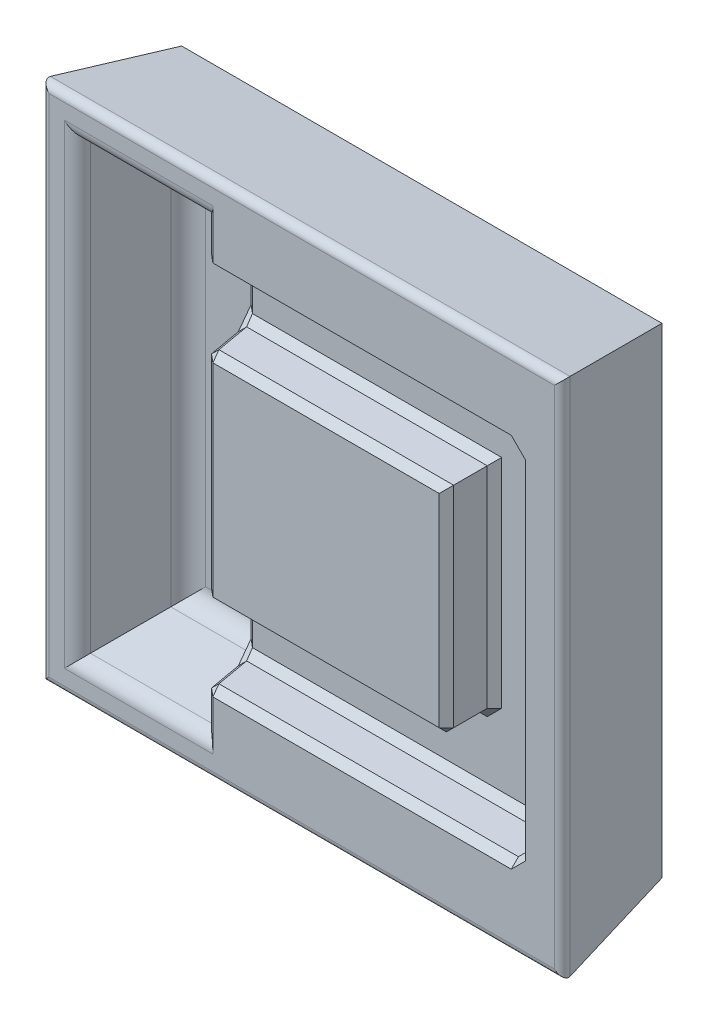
ISO-10303-21;
HEADER;
FILE_DESCRIPTION(('STEP AP214'),'2;1');
FILE_NAME('part.step','',(''),(''),'','','');
FILE_SCHEMA(('AUTOMOTIVE_DESIGN { 1 0 10303 214 1 1 1 1 }'));
ENDSEC;
DATA;
#1=APPLICATION_CONTEXT('core data for automotive mechanical design processes');
#2=APPLICATION_PROTOCOL_DEFINITION('international standard','automotive_design',2000,#1);
#3=PRODUCT_CONTEXT('',#1,'mechanical');
#4=PRODUCT('Part','Part','',(#3));
#5=PRODUCT_RELATED_PRODUCT_CATEGORY('part','',(#4));
#6=PRODUCT_DEFINITION_FORMATION('','',#4);
#7=PRODUCT_DEFINITION_CONTEXT('part definition',#1,'design');
#8=PRODUCT_DEFINITION('design','',#6,#7);
#9=PRODUCT_DEFINITION_SHAPE('','',#8);
#10=(LENGTH_UNIT() NAMED_UNIT(*) SI_UNIT(.MILLI.,.METRE.));
#11=(NAMED_UNIT(*) PLANE_ANGLE_UNIT() SI_UNIT($,.RADIAN.));
#12=(NAMED_UNIT(*) SI_UNIT($,.STERADIAN.) SOLID_ANGLE_UNIT());
#13=UNCERTAINTY_MEASURE_WITH_UNIT(LENGTH_MEASURE(1.E-05),#10,'distance_accuracy_value','');
#14=(GEOMETRIC_REPRESENTATION_CONTEXT(3) GLOBAL_UNCERTAINTY_ASSIGNED_CONTEXT((#13)) GLOBAL_UNIT_ASSIGNED_CONTEXT((#10,
#11,#12)) REPRESENTATION_CONTEXT('',''));
#15=CARTESIAN_POINT('',(0.,0.,0.));
#16=DIRECTION('',(0.,0.,1.));
#17=DIRECTION('',(1.,0.,0.));
#18=AXIS2_PLACEMENT_3D('',#15,#16,#17);
#19=CARTESIAN_POINT('',(-100.,-100.,50.));
#20=DIRECTION('',(0.,0.,1.));
#21=DIRECTION('',(1.,0.,0.));
#22=AXIS2_PLACEMENT_3D('',#19,#20,#21);
#23=PLANE('',#22);
#24=DIRECTION('',(1.,0.,0.));
#25=VECTOR('',#24,1.);
#26=CARTESIAN_POINT('',(-108.816349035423,105.241088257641,50.));
#27=LINE('',#26,#25);
#28=CARTESIAN_POINT('',(105.241088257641,105.241088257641,50.));
#29=VERTEX_POINT('',#28);
#30=CARTESIAN_POINT('',(-105.241088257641,105.241088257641,50.));
#31=VERTEX_POINT('',#30);
#32=EDGE_CURVE('E1336',#29,#31,#27,.F.);
#33=ORIENTED_EDGE('',*,*,#32,.T.);
#34=DIRECTION('',(0.,1.,0.));
#35=VECTOR('',#34,1.);
#36=CARTESIAN_POINT('',(-105.241088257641,-108.816349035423,50.));
#37=LINE('',#36,#35);
#38=CARTESIAN_POINT('',(-105.241088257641,-105.241088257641,50.));
#39=VERTEX_POINT('',#38);
#40=EDGE_CURVE('E1342',#31,#39,#37,.F.);
#41=ORIENTED_EDGE('',*,*,#40,.T.);
#42=DIRECTION('',(-1.,0.,0.));
#43=VECTOR('',#42,1.);
#44=CARTESIAN_POINT('',(108.816349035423,-105.241088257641,50.));
#45=LINE('',#44,#43);
#46=CARTESIAN_POINT('',(105.241088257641,-105.241088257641,50.));
#47=VERTEX_POINT('',#46);
#48=EDGE_CURVE('E1340',#39,#47,#45,.F.);
#49=ORIENTED_EDGE('',*,*,#48,.T.);
#50=DIRECTION('',(0.,-1.,0.));
#51=VECTOR('',#50,1.);
#52=CARTESIAN_POINT('',(105.241088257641,108.816349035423,50.));
#53=LINE('',#52,#51);
#54=EDGE_CURVE('E1338',#47,#29,#53,.F.);
#55=ORIENTED_EDGE('',*,*,#54,.T.);
#56=EDGE_LOOP('',(#33,#41,#49,#55));
#57=FACE_BOUND('',#56,.T.);
#58=DIRECTION('',(0.,-1.,0.));
#59=VECTOR('',#58,1.);
#60=CARTESIAN_POINT('',(-37.,-98.8509468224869,50.));
#61=LINE('',#60,#59);
#62=CARTESIAN_POINT('',(-37.,-78.2410882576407,50.));
#63=VERTEX_POINT('',#62);
#64=CARTESIAN_POINT('',(-37.,-98.8509468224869,50.));
#65=VERTEX_POINT('',#64);
#66=EDGE_CURVE('E662',#63,#65,#61,.T.);
#67=ORIENTED_EDGE('',*,*,#66,.T.);
#68=DIRECTION('',(1.,0.,0.));
#69=VECTOR('',#68,1.);
#70=CARTESIAN_POINT('',(-93.8163490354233,-98.8509468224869,50.));
#71=LINE('',#70,#69);
#72=CARTESIAN_POINT('',(-98.8509468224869,-98.8509468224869,50.));
#73=VERTEX_POINT('',#72);
#74=EDGE_CURVE('E783',#65,#73,#71,.F.);
#75=ORIENTED_EDGE('',*,*,#74,.T.);
#76=DIRECTION('',(0.,-1.,0.));
#77=VECTOR('',#76,1.);
#78=CARTESIAN_POINT('',(-98.850946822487,93.8163490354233,50.));
#79=LINE('',#78,#77);
#80=CARTESIAN_POINT('',(-98.850946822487,98.8509468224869,50.));
#81=VERTEX_POINT('',#80);
#82=EDGE_CURVE('E1326',#73,#81,#79,.F.);
#83=ORIENTED_EDGE('',*,*,#82,.T.);
#84=DIRECTION('',(-1.,0.,0.));
#85=VECTOR('',#84,1.);
#86=CARTESIAN_POINT('',(-40.,98.8509468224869,50.));
#87=LINE('',#86,#85);
#88=CARTESIAN_POINT('',(-37.,98.8509468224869,50.));
#89=VERTEX_POINT('',#88);
#90=EDGE_CURVE('E1333',#81,#89,#87,.F.);
#91=ORIENTED_EDGE('',*,*,#90,.T.);
#92=DIRECTION('',(0.,-1.,0.));
#93=VECTOR('',#92,1.);
#94=CARTESIAN_POINT('',(-37.,75.2410882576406,50.));
#95=LINE('',#94,#93);
#96=CARTESIAN_POINT('',(-37.,78.2410882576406,50.));
#97=VERTEX_POINT('',#96);
#98=EDGE_CURVE('E652',#89,#97,#95,.T.);
#99=ORIENTED_EDGE('',*,*,#98,.T.);
#100=DIRECTION('',(1.,0.,0.));
#101=VECTOR('',#100,1.);
#102=CARTESIAN_POINT('',(90.2410882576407,78.2410882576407,50.));
#103=LINE('',#102,#101);
#104=CARTESIAN_POINT('',(87.2410882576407,78.2410882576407,50.));
#105=VERTEX_POINT('',#104);
#106=EDGE_CURVE('E635',#97,#105,#103,.T.);
#107=ORIENTED_EDGE('',*,*,#106,.T.);
#108=DIRECTION('',(-0.707106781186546,0.707106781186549,0.));
#109=VECTOR('',#108,1.);
#110=CARTESIAN_POINT('',(82.7410882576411,82.7410882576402,50.));
#111=LINE('',#110,#109);
#112=CARTESIAN_POINT('',(90.2410882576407,75.2410882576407,50.));
#113=VERTEX_POINT('',#112);
#114=EDGE_CURVE('E629',#113,#105,#111,.T.);
#115=ORIENTED_EDGE('',*,*,#114,.F.);
#116=DIRECTION('',(-0.707106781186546,0.707106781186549,0.));
#117=VECTOR('',#116,1.);
#118=CARTESIAN_POINT('',(82.7410882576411,82.7410882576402,50.));
#119=LINE('',#118,#117);
#120=CARTESIAN_POINT('',(93.2410882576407,72.2410882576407,50.));
#121=VERTEX_POINT('',#120);
#122=EDGE_CURVE('E632',#121,#113,#119,.T.);
#123=ORIENTED_EDGE('',*,*,#122,.F.);
#124=DIRECTION('',(0.,-1.,0.));
#125=VECTOR('',#124,1.);
#126=CARTESIAN_POINT('',(93.2410882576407,-100.,50.));
#127=LINE('',#126,#125);
#128=CARTESIAN_POINT('',(93.2410882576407,-72.2410882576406,50.));
#129=VERTEX_POINT('',#128);
#130=EDGE_CURVE('E647',#121,#129,#127,.T.);
#131=ORIENTED_EDGE('',*,*,#130,.T.);
#132=DIRECTION('',(0.707106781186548,0.707106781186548,0.));
#133=VECTOR('',#132,1.);
#134=CARTESIAN_POINT('',(-17.2589117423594,-182.741088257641,50.));
#135=LINE('',#134,#133);
#136=CARTESIAN_POINT('',(90.2410882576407,-75.2410882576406,50.));
#137=VERTEX_POINT('',#136);
#138=EDGE_CURVE('E654',#137,#129,#135,.T.);
#139=ORIENTED_EDGE('',*,*,#138,.F.);
#140=DIRECTION('',(0.707106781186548,0.707106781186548,0.));
#141=VECTOR('',#140,1.);
#142=CARTESIAN_POINT('',(-17.2589117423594,-182.741088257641,50.));
#143=LINE('',#142,#141);
#144=CARTESIAN_POINT('',(87.2410882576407,-78.2410882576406,50.));
#145=VERTEX_POINT('',#144);
#146=EDGE_CURVE('E657',#145,#137,#143,.T.);
#147=ORIENTED_EDGE('',*,*,#146,.F.);
#148=DIRECTION('',(-1.,0.,0.));
#149=VECTOR('',#148,1.);
#150=CARTESIAN_POINT('',(-40.,-78.2410882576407,50.));
#151=LINE('',#150,#149);
#152=EDGE_CURVE('E660',#145,#63,#151,.T.);
#153=ORIENTED_EDGE('',*,*,#152,.T.);
#154=EDGE_LOOP('',(#67,#75,#83,#91,#99,#107,#115,#123,#131,#139,#147,#153));
#155=FACE_BOUND('',#154,.T.);
#156=ADVANCED_FACE('F350',(#57,#155),#23,.T.);
#157=CARTESIAN_POINT('',(-100.,100.,0.));
#158=DIRECTION('',(-0.984807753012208,0.,-0.173648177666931));
#159=DIRECTION('',(-0.173648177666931,0.,0.984807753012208));
#160=AXIS2_PLACEMENT_3D('',#157,#158,#159);
#161=PLANE('',#160);
#162=DIRECTION('',(0.171087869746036,0.171087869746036,-0.970287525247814));
#163=VECTOR('',#162,1.);
#164=CARTESIAN_POINT('',(-100.,-100.,0.));
#165=LINE('',#164,#163);
#166=CARTESIAN_POINT('',(-108.195511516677,-108.195511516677,46.4790554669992));
#167=VERTEX_POINT('',#166);
#168=CARTESIAN_POINT('',(-100.,-100.,0.));
#169=VERTEX_POINT('',#168);
#170=EDGE_CURVE('E1324',#167,#169,#165,.T.);
#171=ORIENTED_EDGE('',*,*,#170,.F.);
#172=DIRECTION('',(0.,-1.,0.));
#173=VECTOR('',#172,1.);
#174=CARTESIAN_POINT('',(-108.195511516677,108.816349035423,46.4790554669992));
#175=LINE('',#174,#173);
#176=CARTESIAN_POINT('',(-108.195511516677,108.195511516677,46.4790554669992));
#177=VERTEX_POINT('',#176);
#178=EDGE_CURVE('E1345',#167,#177,#175,.F.);
#179=ORIENTED_EDGE('',*,*,#178,.T.);
#180=DIRECTION('',(0.171087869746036,-0.171087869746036,-0.970287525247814));
#181=VECTOR('',#180,1.);
#182=CARTESIAN_POINT('',(-100.,100.,0.));
#183=LINE('',#182,#181);
#184=CARTESIAN_POINT('',(-100.,100.,0.));
#185=VERTEX_POINT('',#184);
#186=EDGE_CURVE('E1323',#177,#185,#183,.T.);
#187=ORIENTED_EDGE('',*,*,#186,.T.);
#188=DIRECTION('',(0.,-1.,0.));
#189=VECTOR('',#188,1.);
#190=CARTESIAN_POINT('',(-100.,100.,0.));
#191=LINE('',#190,#189);
#192=EDGE_CURVE('E1305',#185,#169,#191,.T.);
#193=ORIENTED_EDGE('',*,*,#192,.T.);
#194=EDGE_LOOP('',(#171,#179,#187,#193));
#195=FACE_BOUND('',#194,.T.);
#196=ADVANCED_FACE('F1081',(#195),#161,.T.);
#197=CARTESIAN_POINT('',(-100.,-100.,0.));
#198=DIRECTION('',(0.,-0.984807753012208,-0.173648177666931));
#199=DIRECTION('',(0.,0.173648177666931,-0.984807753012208));
#200=AXIS2_PLACEMENT_3D('',#197,#198,#199);
#201=PLANE('',#200);
#202=DIRECTION('',(-0.171087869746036,0.171087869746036,-0.970287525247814));
#203=VECTOR('',#202,1.);
#204=CARTESIAN_POINT('',(94.1457881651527,-94.1457881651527,-33.2008851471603));
#205=LINE('',#204,#203);
#206=CARTESIAN_POINT('',(108.195511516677,-108.195511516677,46.4790554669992));
#207=VERTEX_POINT('',#206);
#208=CARTESIAN_POINT('',(100.,-100.,0.));
#209=VERTEX_POINT('',#208);
#210=EDGE_CURVE('E1327',#207,#209,#205,.T.);
#211=ORIENTED_EDGE('',*,*,#210,.F.);
#212=DIRECTION('',(1.,0.,0.));
#213=VECTOR('',#212,1.);
#214=CARTESIAN_POINT('',(-108.816349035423,-108.195511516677,46.4790554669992));
#215=LINE('',#214,#213);
#216=EDGE_CURVE('E1348',#207,#167,#215,.F.);
#217=ORIENTED_EDGE('',*,*,#216,.T.);
#218=ORIENTED_EDGE('',*,*,#170,.T.);
#219=DIRECTION('',(1.,0.,0.));
#220=VECTOR('',#219,1.);
#221=CARTESIAN_POINT('',(-100.,-100.,0.));
#222=LINE('',#221,#220);
#223=EDGE_CURVE('E1314',#169,#209,#222,.T.);
#224=ORIENTED_EDGE('',*,*,#223,.T.);
#225=EDGE_LOOP('',(#211,#217,#218,#224));
#226=FACE_BOUND('',#225,.T.);
#227=ADVANCED_FACE('F1088',(#226),#201,.T.);
#228=CARTESIAN_POINT('',(100.,100.,0.));
#229=DIRECTION('',(0.984807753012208,0.,-0.173648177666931));
#230=DIRECTION('',(-0.173648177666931,0.,-0.984807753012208));
#231=AXIS2_PLACEMENT_3D('',#228,#229,#230);
#232=PLANE('',#231);
#233=DIRECTION('',(-0.171087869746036,-0.171087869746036,-0.970287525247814));
#234=VECTOR('',#233,1.);
#235=CARTESIAN_POINT('',(94.1457881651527,94.1457881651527,-33.2008851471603));
#236=LINE('',#235,#234);
#237=CARTESIAN_POINT('',(108.195511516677,108.195511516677,46.4790554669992));
#238=VERTEX_POINT('',#237);
#239=CARTESIAN_POINT('',(100.,100.,0.));
#240=VERTEX_POINT('',#239);
#241=EDGE_CURVE('E1329',#238,#240,#236,.T.);
#242=ORIENTED_EDGE('',*,*,#241,.F.);
#243=DIRECTION('',(0.,1.,0.));
#244=VECTOR('',#243,1.);
#245=CARTESIAN_POINT('',(108.195511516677,-108.816349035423,46.4790554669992));
#246=LINE('',#245,#244);
#247=EDGE_CURVE('E1350',#238,#207,#246,.F.);
#248=ORIENTED_EDGE('',*,*,#247,.T.);
#249=ORIENTED_EDGE('',*,*,#210,.T.);
#250=DIRECTION('',(0.,1.,0.));
#251=VECTOR('',#250,1.);
#252=CARTESIAN_POINT('',(100.,100.,0.));
#253=LINE('',#252,#251);
#254=EDGE_CURVE('E1317',#209,#240,#253,.T.);
#255=ORIENTED_EDGE('',*,*,#254,.T.);
#256=EDGE_LOOP('',(#242,#248,#249,#255));
#257=FACE_BOUND('',#256,.T.);
#258=ADVANCED_FACE('F1095',(#257),#232,.T.);
#259=CARTESIAN_POINT('',(-100.,100.,0.));
#260=DIRECTION('',(0.,0.984807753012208,-0.173648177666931));
#261=DIRECTION('',(0.,0.173648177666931,0.984807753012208));
#262=AXIS2_PLACEMENT_3D('',#259,#260,#261);
#263=PLANE('',#262);
#264=ORIENTED_EDGE('',*,*,#186,.F.);
#265=DIRECTION('',(-1.,0.,0.));
#266=VECTOR('',#265,1.);
#267=CARTESIAN_POINT('',(108.816349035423,108.195511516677,46.4790554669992));
#268=LINE('',#267,#266);
#269=EDGE_CURVE('E1352',#177,#238,#268,.F.);
#270=ORIENTED_EDGE('',*,*,#269,.T.);
#271=ORIENTED_EDGE('',*,*,#241,.T.);
#272=DIRECTION('',(-1.,0.,0.));
#273=VECTOR('',#272,1.);
#274=CARTESIAN_POINT('',(-100.,100.,0.));
#275=LINE('',#274,#273);
#276=EDGE_CURVE('E1320',#240,#185,#275,.T.);
#277=ORIENTED_EDGE('',*,*,#276,.T.);
#278=EDGE_LOOP('',(#264,#270,#271,#277));
#279=FACE_BOUND('',#278,.T.);
#280=ADVANCED_FACE('F1091',(#279),#263,.T.);
#281=DIRECTION('',(-1.,0.,0.));
#282=VECTOR('',#281,1.);
#283=CARTESIAN_POINT('',(-40.,42.2410882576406,50.));
#284=LINE('',#283,#282);
#285=CARTESIAN_POINT('',(57.2410882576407,42.2410882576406,50.));
#286=VERTEX_POINT('',#285);
#287=CARTESIAN_POINT('',(-37.,42.2410882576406,50.));
#288=VERTEX_POINT('',#287);
#289=EDGE_CURVE('E664',#286,#288,#284,.T.);
#290=ORIENTED_EDGE('',*,*,#289,.T.);
#291=DIRECTION('',(0.,-1.,0.));
#292=VECTOR('',#291,1.);
#293=CARTESIAN_POINT('',(-37.,-45.2410882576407,50.));
#294=LINE('',#293,#292);
#295=CARTESIAN_POINT('',(-37.,-42.2410882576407,50.));
#296=VERTEX_POINT('',#295);
#297=EDGE_CURVE('E670',#288,#296,#294,.T.);
#298=ORIENTED_EDGE('',*,*,#297,.T.);
#299=DIRECTION('',(1.,0.,0.));
#300=VECTOR('',#299,1.);
#301=CARTESIAN_POINT('',(60.2410882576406,-42.2410882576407,50.));
#302=LINE('',#301,#300);
#303=CARTESIAN_POINT('',(57.2410882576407,-42.2410882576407,50.));
#304=VERTEX_POINT('',#303);
#305=EDGE_CURVE('E668',#296,#304,#302,.T.);
#306=ORIENTED_EDGE('',*,*,#305,.T.);
#307=DIRECTION('',(0.,1.,0.));
#308=VECTOR('',#307,1.);
#309=CARTESIAN_POINT('',(57.2410882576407,-100.,50.));
#310=LINE('',#309,#308);
#311=EDGE_CURVE('E666',#304,#286,#310,.T.);
#312=ORIENTED_EDGE('',*,*,#311,.T.);
#313=EDGE_LOOP('',(#290,#298,#306,#312));
#314=FACE_BOUND('',#313,.T.);
#315=ADVANCED_FACE('F1077',(#314),#23,.T.);
#316=CARTESIAN_POINT('',(-100.,-100.,0.));
#317=DIRECTION('',(0.,0.,1.));
#318=DIRECTION('',(1.,0.,0.));
#319=AXIS2_PLACEMENT_3D('',#316,#317,#318);
#320=PLANE('',#319);
#321=ORIENTED_EDGE('',*,*,#192,.F.);
#322=ORIENTED_EDGE('',*,*,#276,.F.);
#323=ORIENTED_EDGE('',*,*,#254,.F.);
#324=ORIENTED_EDGE('',*,*,#223,.F.);
#325=EDGE_LOOP('',(#321,#322,#323,#324));
#326=FACE_BOUND('',#325,.T.);
#327=ADVANCED_FACE('F1069',(#326),#320,.F.);
#328=CARTESIAN_POINT('',(-93.8163490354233,93.8163490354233,50.));
#329=DIRECTION('',(-0.984807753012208,0.,-0.173648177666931));
#330=DIRECTION('',(-0.173648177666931,0.,0.984807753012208));
#331=AXIS2_PLACEMENT_3D('',#328,#329,#330);
#332=PLANE('',#331);
#333=DIRECTION('',(-0.171087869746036,0.171087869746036,0.970287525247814));
#334=VECTOR('',#333,1.);
#335=CARTESIAN_POINT('',(-93.8163490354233,93.8163490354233,50.));
#336=LINE('',#335,#334);
#337=CARTESIAN_POINT('',(-87.9289347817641,87.9289347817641,16.6108145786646));
#338=VERTEX_POINT('',#337);
#339=CARTESIAN_POINT('',(-92.9421003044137,92.9421003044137,45.0418890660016));
#340=VERTEX_POINT('',#339);
#341=EDGE_CURVE('E1303',#338,#340,#336,.T.);
#342=ORIENTED_EDGE('',*,*,#341,.T.);
#343=DIRECTION('',(0.,-1.,0.));
#344=VECTOR('',#343,1.);
#345=CARTESIAN_POINT('',(-92.9421003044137,-93.8163490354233,45.0418890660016));
#346=LINE('',#345,#344);
#347=CARTESIAN_POINT('',(-92.9421003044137,-92.9421003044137,45.0418890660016));
#348=VERTEX_POINT('',#347);
#349=EDGE_CURVE('E1364',#340,#348,#346,.T.);
#350=ORIENTED_EDGE('',*,*,#349,.T.);
#351=DIRECTION('',(-0.171087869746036,-0.171087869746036,0.970287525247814));
#352=VECTOR('',#351,1.);
#353=CARTESIAN_POINT('',(-88.3241412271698,-88.3241412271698,18.8521417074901));
#354=LINE('',#353,#352);
#355=CARTESIAN_POINT('',(-87.9289347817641,-87.9289347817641,16.6108145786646));
#356=VERTEX_POINT('',#355);
#357=EDGE_CURVE('E1302',#356,#348,#354,.T.);
#358=ORIENTED_EDGE('',*,*,#357,.F.);
#359=DIRECTION('',(0.,-1.,0.));
#360=VECTOR('',#359,1.);
#361=CARTESIAN_POINT('',(-87.9289347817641,93.8163490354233,16.6108145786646));
#362=LINE('',#361,#360);
#363=EDGE_CURVE('E1362',#356,#338,#362,.F.);
#364=ORIENTED_EDGE('',*,*,#363,.T.);
#365=EDGE_LOOP('',(#342,#350,#358,#364));
#366=FACE_BOUND('',#365,.T.);
#367=ADVANCED_FACE('F1067',(#366),#332,.F.);
#368=CARTESIAN_POINT('',(-93.8163490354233,93.8163490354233,50.));
#369=DIRECTION('',(0.,0.984807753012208,-0.173648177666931));
#370=DIRECTION('',(0.,0.173648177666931,0.984807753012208));
#371=AXIS2_PLACEMENT_3D('',#368,#369,#370);
#372=PLANE('',#371);
#373=DIRECTION('',(0.171087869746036,0.171087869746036,0.970287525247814));
#374=VECTOR('',#373,1.);
#375=CARTESIAN_POINT('',(-40.,93.8163490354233,50.));
#376=LINE('',#375,#374);
#377=CARTESIAN_POINT('',(-45.8874142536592,87.9289347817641,16.6108145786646));
#378=VERTEX_POINT('',#377);
#379=CARTESIAN_POINT('',(-40.8742487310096,92.9421003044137,45.0418890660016));
#380=VERTEX_POINT('',#379);
#381=EDGE_CURVE('E1306',#378,#380,#376,.T.);
#382=ORIENTED_EDGE('',*,*,#381,.T.);
#383=DIRECTION('',(-1.,0.,0.));
#384=VECTOR('',#383,1.);
#385=CARTESIAN_POINT('',(-93.8163490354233,92.9421003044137,45.0418890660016));
#386=LINE('',#385,#384);
#387=EDGE_CURVE('E1360',#380,#340,#386,.T.);
#388=ORIENTED_EDGE('',*,*,#387,.T.);
#389=ORIENTED_EDGE('',*,*,#341,.F.);
#390=DIRECTION('',(-1.,0.,0.));
#391=VECTOR('',#390,1.);
#392=CARTESIAN_POINT('',(-93.8163490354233,87.9289347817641,16.6108145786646));
#393=LINE('',#392,#391);
#394=EDGE_CURVE('E1358',#338,#378,#393,.F.);
#395=ORIENTED_EDGE('',*,*,#394,.T.);
#396=EDGE_LOOP('',(#382,#388,#389,#395));
#397=FACE_BOUND('',#396,.T.);
#398=ADVANCED_FACE('F743',(#397),#372,.F.);
#399=CARTESIAN_POINT('',(-40.,93.8163490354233,50.));
#400=DIRECTION('',(0.984807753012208,0.,-0.173648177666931));
#401=DIRECTION('',(-0.173648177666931,0.,-0.984807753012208));
#402=AXIS2_PLACEMENT_3D('',#399,#400,#401);
#403=PLANE('',#402);
#404=DIRECTION('',(-0.173648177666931,0.,-0.984807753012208));
#405=VECTOR('',#404,1.);
#406=CARTESIAN_POINT('',(-40.,-78.2410882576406,49.9999999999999));
#407=LINE('',#406,#405);
#408=CARTESIAN_POINT('',(-40.5209445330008,-78.2410882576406,47.0455767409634));
#409=VERTEX_POINT('',#408);
#410=CARTESIAN_POINT('',(-42.9057020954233,-78.2410882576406,33.5209445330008));
#411=VERTEX_POINT('',#410);
#412=EDGE_CURVE('E801',#409,#411,#407,.T.);
#413=ORIENTED_EDGE('',*,*,#412,.T.);
#414=CARTESIAN_POINT('',(-44.0474841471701,-72.2410882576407,27.0455767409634));
#415=CARTESIAN_POINT('',(-43.9492231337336,-72.7574443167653,27.6028426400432));
#416=CARTESIAN_POINT('',(-43.850962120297,-73.2738003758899,28.160108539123));
#417=CARTESIAN_POINT('',(-43.654440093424,-74.3065124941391,29.2746403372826));
#418=CARTESIAN_POINT('',(-43.5561790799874,-74.8228685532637,29.8319062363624));
#419=CARTESIAN_POINT('',(-43.273846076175,-76.3065124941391,31.4330962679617));
#420=CARTESIAN_POINT('',(-43.0897740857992,-77.2738003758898,32.4770204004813));
#421=CARTESIAN_POINT('',(-42.9057020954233,-78.2410882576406,33.5209445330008));
#422=B_SPLINE_CURVE_WITH_KNOTS('',3,(#414,#415,#416,#417,#418,#419,#420,#421),.UNSPECIFIED.,.F.,
.F.,(4,2,2,4),(0.,2.29813332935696,4.59626665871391,8.90135126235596),.UNSPECIFIED.);
#423=CARTESIAN_POINT('',(-44.0474841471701,-72.2410882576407,27.0455767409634));
#424=VERTEX_POINT('',#423);
#425=EDGE_CURVE('E755',#411,#424,#422,.F.);
#426=ORIENTED_EDGE('',*,*,#425,.T.);
#427=DIRECTION('',(0.,1.,0.));
#428=VECTOR('',#427,1.);
#429=CARTESIAN_POINT('',(-44.0474841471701,93.8163490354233,27.0455767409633));
#430=LINE('',#429,#428);
#431=CARTESIAN_POINT('',(-44.0474841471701,-48.2410882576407,27.0455767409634));
#432=VERTEX_POINT('',#431);
#433=EDGE_CURVE('E815',#424,#432,#430,.T.);
#434=ORIENTED_EDGE('',*,*,#433,.T.);
#435=CARTESIAN_POINT('',(-42.9057020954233,-42.2410882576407,33.5209445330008));
#436=CARTESIAN_POINT('',(-43.0039631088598,-42.7574443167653,32.963678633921));
#437=CARTESIAN_POINT('',(-43.1022241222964,-43.2738003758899,32.4064127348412));
#438=CARTESIAN_POINT('',(-43.2987461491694,-44.3065124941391,31.2918809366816));
#439=CARTESIAN_POINT('',(-43.3970071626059,-44.8228685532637,30.7346150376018));
#440=CARTESIAN_POINT('',(-43.6793401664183,-46.3065124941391,29.1334250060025));
#441=CARTESIAN_POINT('',(-43.8634121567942,-47.2738003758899,28.0895008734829));
#442=CARTESIAN_POINT('',(-44.0474841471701,-48.2410882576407,27.0455767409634));
#443=B_SPLINE_CURVE_WITH_KNOTS('',3,(#435,#436,#437,#438,#439,#440,#441,#442),.UNSPECIFIED.,.F.,
.F.,(4,2,2,4),(0.,2.29813332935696,4.59626665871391,8.90135126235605),.UNSPECIFIED.);
#444=CARTESIAN_POINT('',(-42.9057020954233,-42.2410882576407,33.5209445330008));
#445=VERTEX_POINT('',#444);
#446=EDGE_CURVE('E727',#432,#445,#443,.F.);
#447=ORIENTED_EDGE('',*,*,#446,.T.);
#448=DIRECTION('',(0.173648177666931,0.,0.984807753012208));
#449=VECTOR('',#448,1.);
#450=CARTESIAN_POINT('',(-40.,-42.2410882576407,50.));
#451=LINE('',#450,#449);
#452=CARTESIAN_POINT('',(-40.5209445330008,-42.2410882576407,47.0455767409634));
#453=VERTEX_POINT('',#452);
#454=EDGE_CURVE('E813',#445,#453,#451,.T.);
#455=ORIENTED_EDGE('',*,*,#454,.T.);
#456=DIRECTION('',(0.,1.,0.));
#457=VECTOR('',#456,1.);
#458=CARTESIAN_POINT('',(-40.5209445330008,45.2410882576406,47.0455767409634));
#459=LINE('',#458,#457);
#460=CARTESIAN_POINT('',(-40.5209445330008,42.2410882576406,47.0455767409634));
#461=VERTEX_POINT('',#460);
#462=EDGE_CURVE('E811',#453,#461,#459,.T.);
#463=ORIENTED_EDGE('',*,*,#462,.T.);
#464=DIRECTION('',(-0.173648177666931,0.,-0.984807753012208));
#465=VECTOR('',#464,1.);
#466=CARTESIAN_POINT('',(-40.,42.2410882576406,50.));
#467=LINE('',#466,#465);
#468=CARTESIAN_POINT('',(-42.9057020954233,42.2410882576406,33.5209445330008));
#469=VERTEX_POINT('',#468);
#470=EDGE_CURVE('E809',#461,#469,#467,.T.);
#471=ORIENTED_EDGE('',*,*,#470,.T.);
#472=CARTESIAN_POINT('',(-44.0474841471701,48.2410882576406,27.0455767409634));
#473=CARTESIAN_POINT('',(-43.9492231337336,47.724732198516,27.6028426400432));
#474=CARTESIAN_POINT('',(-43.8509621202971,47.2083761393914,28.160108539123));
#475=CARTESIAN_POINT('',(-43.654440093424,46.1756640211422,29.2746403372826));
#476=CARTESIAN_POINT('',(-43.5561790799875,45.6593079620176,29.8319062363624));
#477=CARTESIAN_POINT('',(-43.273846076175,44.1756640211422,31.4330962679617));
#478=CARTESIAN_POINT('',(-43.0897740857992,43.2083761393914,32.4770204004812));
#479=CARTESIAN_POINT('',(-42.9057020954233,42.2410882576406,33.5209445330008));
#480=B_SPLINE_CURVE_WITH_KNOTS('',3,(#472,#473,#474,#475,#476,#477,#478,#479),.UNSPECIFIED.,.F.,
.F.,(4,2,2,4),(0.,2.29813332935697,4.59626665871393,8.90135126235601),.UNSPECIFIED.);
#481=CARTESIAN_POINT('',(-44.0474841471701,48.2410882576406,27.0455767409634));
#482=VERTEX_POINT('',#481);
#483=EDGE_CURVE('E751',#469,#482,#480,.F.);
#484=ORIENTED_EDGE('',*,*,#483,.T.);
#485=DIRECTION('',(0.,1.,0.));
#486=VECTOR('',#485,1.);
#487=CARTESIAN_POINT('',(-44.0474841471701,93.8163490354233,27.0455767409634));
#488=LINE('',#487,#486);
#489=CARTESIAN_POINT('',(-44.0474841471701,72.2410882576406,27.0455767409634));
#490=VERTEX_POINT('',#489);
#491=EDGE_CURVE('E817',#482,#490,#488,.T.);
#492=ORIENTED_EDGE('',*,*,#491,.T.);
#493=CARTESIAN_POINT('',(-42.9057020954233,78.2410882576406,33.5209445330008));
#494=CARTESIAN_POINT('',(-43.0039631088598,77.724732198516,32.963678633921));
#495=CARTESIAN_POINT('',(-43.1022241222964,77.2083761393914,32.4064127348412));
#496=CARTESIAN_POINT('',(-43.2987461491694,76.1756640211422,31.2918809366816));
#497=CARTESIAN_POINT('',(-43.397007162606,75.6593079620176,30.7346150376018));
#498=CARTESIAN_POINT('',(-43.6793401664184,74.1756640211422,29.1334250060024));
#499=CARTESIAN_POINT('',(-43.8634121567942,73.2083761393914,28.0895008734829));
#500=CARTESIAN_POINT('',(-44.0474841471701,72.2410882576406,27.0455767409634));
#501=B_SPLINE_CURVE_WITH_KNOTS('',3,(#493,#494,#495,#496,#497,#498,#499,#500),.UNSPECIFIED.,.F.,
.F.,(4,2,2,4),(0.,2.29813332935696,4.59626665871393,8.90135126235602),.UNSPECIFIED.);
#502=CARTESIAN_POINT('',(-42.9057020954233,78.2410882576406,33.5209445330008));
#503=VERTEX_POINT('',#502);
#504=EDGE_CURVE('E720',#490,#503,#501,.F.);
#505=ORIENTED_EDGE('',*,*,#504,.T.);
#506=DIRECTION('',(0.173648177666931,0.,0.984807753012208));
#507=VECTOR('',#506,1.);
#508=CARTESIAN_POINT('',(-40.,78.2410882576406,50.));
#509=LINE('',#508,#507);
#510=CARTESIAN_POINT('',(-40.5209445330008,78.2410882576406,47.0455767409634));
#511=VERTEX_POINT('',#510);
#512=EDGE_CURVE('E800',#503,#511,#509,.T.);
#513=ORIENTED_EDGE('',*,*,#512,.T.);
#514=DIRECTION('',(0.,1.,0.));
#515=VECTOR('',#514,1.);
#516=CARTESIAN_POINT('',(-40.5209445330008,98.8509468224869,47.0455767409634));
#517=LINE('',#516,#515);
#518=CARTESIAN_POINT('',(-40.5209445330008,93.6813760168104,47.0455767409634));
#519=VERTEX_POINT('',#518);
#520=EDGE_CURVE('E803',#511,#519,#517,.T.);
#521=ORIENTED_EDGE('',*,*,#520,.T.);
#522=CARTESIAN_POINT('',(-41.0579618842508,98.8509468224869,44.));
#523=DIRECTION('',(0.984807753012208,0.,-0.173648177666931));
#524=DIRECTION('',(0.173648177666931,0.,0.984807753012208));
#525=AXIS2_PLACEMENT_3D('',#522,#523,#524);
#526=ELLIPSE('',#525,6.09255967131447,6.);
#527=EDGE_CURVE('E793',#519,#380,#526,.T.);
#528=ORIENTED_EDGE('',*,*,#527,.T.);
#529=ORIENTED_EDGE('',*,*,#381,.F.);
#530=DIRECTION('',(0.,1.,0.));
#531=VECTOR('',#530,1.);
#532=CARTESIAN_POINT('',(-45.8874142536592,93.8163490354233,16.6108145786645));
#533=LINE('',#532,#531);
#534=CARTESIAN_POINT('',(-45.8874142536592,-87.9289347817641,16.6108145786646));
#535=VERTEX_POINT('',#534);
#536=EDGE_CURVE('E794',#378,#535,#533,.F.);
#537=ORIENTED_EDGE('',*,*,#536,.T.);
#538=DIRECTION('',(0.171087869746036,-0.171087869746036,0.970287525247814));
#539=VECTOR('',#538,1.);
#540=CARTESIAN_POINT('',(-41.5752615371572,-92.241087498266,41.0662478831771));
#541=LINE('',#540,#539);
#542=CARTESIAN_POINT('',(-40.8742487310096,-92.9421003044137,45.0418890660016));
#543=VERTEX_POINT('',#542);
#544=EDGE_CURVE('E792',#535,#543,#541,.T.);
#545=ORIENTED_EDGE('',*,*,#544,.T.);
#546=CARTESIAN_POINT('',(-41.0579618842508,-98.8509468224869,44.));
#547=DIRECTION('',(0.984807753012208,0.,-0.173648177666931));
#548=DIRECTION('',(-0.173648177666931,0.,-0.984807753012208));
#549=AXIS2_PLACEMENT_3D('',#546,#547,#548);
#550=ELLIPSE('',#549,6.09255967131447,6.);
#551=CARTESIAN_POINT('',(-40.5209445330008,-93.6813760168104,47.0455767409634));
#552=VERTEX_POINT('',#551);
#553=EDGE_CURVE('E781',#543,#552,#550,.T.);
#554=ORIENTED_EDGE('',*,*,#553,.T.);
#555=DIRECTION('',(0.,1.,0.));
#556=VECTOR('',#555,1.);
#557=CARTESIAN_POINT('',(-40.5209445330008,-75.2410882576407,47.0455767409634));
#558=LINE('',#557,#556);
#559=EDGE_CURVE('E788',#552,#409,#558,.T.);
#560=ORIENTED_EDGE('',*,*,#559,.T.);
#561=EDGE_LOOP('',(#413,#426,#434,#447,#455,#463,#471,#484,#492,#505,#513,#521,#528,#529,#537,
#545,#554,#560));
#562=FACE_BOUND('',#561,.T.);
#563=ADVANCED_FACE('F737',(#562),#403,.F.);
#564=CARTESIAN_POINT('',(-93.8163490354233,-93.8163490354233,50.));
#565=DIRECTION('',(0.,-0.984807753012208,-0.173648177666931));
#566=DIRECTION('',(0.,0.173648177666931,-0.984807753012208));
#567=AXIS2_PLACEMENT_3D('',#564,#565,#566);
#568=PLANE('',#567);
#569=ORIENTED_EDGE('',*,*,#357,.T.);
#570=DIRECTION('',(1.,0.,0.));
#571=VECTOR('',#570,1.);
#572=CARTESIAN_POINT('',(-40.,-92.9421003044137,45.0418890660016));
#573=LINE('',#572,#571);
#574=EDGE_CURVE('E1356',#348,#543,#573,.T.);
#575=ORIENTED_EDGE('',*,*,#574,.T.);
#576=ORIENTED_EDGE('',*,*,#544,.F.);
#577=DIRECTION('',(1.,0.,0.));
#578=VECTOR('',#577,1.);
#579=CARTESIAN_POINT('',(-93.8163490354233,-87.9289347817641,16.6108145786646));
#580=LINE('',#579,#578);
#581=EDGE_CURVE('E1354',#535,#356,#580,.F.);
#582=ORIENTED_EDGE('',*,*,#581,.T.);
#583=EDGE_LOOP('',(#569,#575,#576,#582));
#584=FACE_BOUND('',#583,.T.);
#585=ADVANCED_FACE('F742',(#584),#568,.F.);
#586=CARTESIAN_POINT('',(-93.8163490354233,-93.8163490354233,10.));
#587=DIRECTION('',(0.,0.,1.));
#588=DIRECTION('',(1.,0.,0.));
#589=AXIS2_PLACEMENT_3D('',#586,#587,#588);
#590=PLANE('',#589);
#591=DIRECTION('',(1.,0.,0.));
#592=VECTOR('',#591,1.);
#593=CARTESIAN_POINT('',(-93.8163490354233,-80.0504727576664,10.));
#594=LINE('',#593,#592);
#595=CARTESIAN_POINT('',(-80.0504727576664,-80.0504727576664,10.));
#596=VERTEX_POINT('',#595);
#597=CARTESIAN_POINT('',(-53.7658762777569,-80.0504727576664,10.));
#598=VERTEX_POINT('',#597);
#599=EDGE_CURVE('E1370',#596,#598,#594,.T.);
#600=ORIENTED_EDGE('',*,*,#599,.T.);
#601=DIRECTION('',(0.,1.,0.));
#602=VECTOR('',#601,1.);
#603=CARTESIAN_POINT('',(-53.7658762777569,-93.8163490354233,10.));
#604=LINE('',#603,#602);
#605=CARTESIAN_POINT('',(-53.7658762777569,80.0504727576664,10.));
#606=VERTEX_POINT('',#605);
#607=EDGE_CURVE('E1372',#598,#606,#604,.T.);
#608=ORIENTED_EDGE('',*,*,#607,.T.);
#609=DIRECTION('',(-1.,0.,0.));
#610=VECTOR('',#609,1.);
#611=CARTESIAN_POINT('',(-93.8163490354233,80.0504727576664,10.));
#612=LINE('',#611,#610);
#613=CARTESIAN_POINT('',(-80.0504727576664,80.0504727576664,10.));
#614=VERTEX_POINT('',#613);
#615=EDGE_CURVE('E1368',#606,#614,#612,.T.);
#616=ORIENTED_EDGE('',*,*,#615,.T.);
#617=DIRECTION('',(0.,-1.,0.));
#618=VECTOR('',#617,1.);
#619=CARTESIAN_POINT('',(-80.0504727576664,-93.8163490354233,10.));
#620=LINE('',#619,#618);
#621=EDGE_CURVE('E1366',#614,#596,#620,.T.);
#622=ORIENTED_EDGE('',*,*,#621,.T.);
#623=EDGE_LOOP('',(#600,#608,#616,#622));
#624=FACE_BOUND('',#623,.T.);
#625=ADVANCED_FACE('F1063',(#624),#590,.T.);
#626=CARTESIAN_POINT('',(105.241088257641,-100.,47.));
#627=DIRECTION('',(0.,1.,0.));
#628=DIRECTION('',(-1.,0.,0.));
#629=AXIS2_PLACEMENT_3D('',#626,#627,#628);
#630=CYLINDRICAL_SURFACE('',#629,3.);
#631=CARTESIAN_POINT('',(105.241088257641,-105.241088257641,47.));
#632=DIRECTION('',(0.707106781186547,0.707106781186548,0.));
#633=DIRECTION('',(-0.707106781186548,0.707106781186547,0.));
#634=AXIS2_PLACEMENT_3D('',#631,#632,#633);
#635=ELLIPSE('',#634,4.24264068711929,3.);
#636=EDGE_CURVE('E1296',#207,#47,#635,.F.);
#637=ORIENTED_EDGE('',*,*,#636,.F.);
#638=ORIENTED_EDGE('',*,*,#247,.F.);
#639=CARTESIAN_POINT('',(105.241088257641,105.241088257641,47.));
#640=DIRECTION('',(-0.707106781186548,0.707106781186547,0.));
#641=DIRECTION('',(-0.707106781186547,-0.707106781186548,0.));
#642=AXIS2_PLACEMENT_3D('',#639,#640,#641);
#643=ELLIPSE('',#642,4.24264068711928,3.);
#644=EDGE_CURVE('E1299',#29,#238,#643,.T.);
#645=ORIENTED_EDGE('',*,*,#644,.F.);
#646=ORIENTED_EDGE('',*,*,#54,.F.);
#647=EDGE_LOOP('',(#637,#638,#645,#646));
#648=FACE_BOUND('',#647,.T.);
#649=ADVANCED_FACE('F1059',(#648),#630,.T.);
#650=CARTESIAN_POINT('',(-100.,105.241088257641,47.));
#651=DIRECTION('',(-1.,0.,0.));
#652=DIRECTION('',(0.,0.,1.));
#653=AXIS2_PLACEMENT_3D('',#650,#651,#652);
#654=CYLINDRICAL_SURFACE('',#653,3.);
#655=ORIENTED_EDGE('',*,*,#644,.T.);
#656=ORIENTED_EDGE('',*,*,#269,.F.);
#657=CARTESIAN_POINT('',(-105.241088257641,105.241088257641,47.));
#658=DIRECTION('',(-0.707106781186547,-0.707106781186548,0.));
#659=DIRECTION('',(-0.707106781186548,0.707106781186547,0.));
#660=AXIS2_PLACEMENT_3D('',#657,#658,#659);
#661=ELLIPSE('',#660,4.24264068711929,3.);
#662=EDGE_CURVE('E1294',#31,#177,#661,.T.);
#663=ORIENTED_EDGE('',*,*,#662,.F.);
#664=ORIENTED_EDGE('',*,*,#32,.F.);
#665=EDGE_LOOP('',(#655,#656,#663,#664));
#666=FACE_BOUND('',#665,.T.);
#667=ADVANCED_FACE('F1055',(#666),#654,.T.);
#668=CARTESIAN_POINT('',(-100.,-105.241088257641,47.));
#669=DIRECTION('',(1.,0.,0.));
#670=DIRECTION('',(0.,0.,-1.));
#671=AXIS2_PLACEMENT_3D('',#668,#669,#670);
#672=CYLINDRICAL_SURFACE('',#671,3.);
#673=ORIENTED_EDGE('',*,*,#636,.T.);
#674=ORIENTED_EDGE('',*,*,#48,.F.);
#675=CARTESIAN_POINT('',(-105.241088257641,-105.241088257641,47.));
#676=DIRECTION('',(0.707106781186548,-0.707106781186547,0.));
#677=DIRECTION('',(0.707106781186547,0.707106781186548,0.));
#678=AXIS2_PLACEMENT_3D('',#675,#676,#677);
#679=ELLIPSE('',#678,4.24264068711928,3.);
#680=EDGE_CURVE('E1292',#167,#39,#679,.F.);
#681=ORIENTED_EDGE('',*,*,#680,.F.);
#682=ORIENTED_EDGE('',*,*,#216,.F.);
#683=EDGE_LOOP('',(#673,#674,#681,#682));
#684=FACE_BOUND('',#683,.T.);
#685=ADVANCED_FACE('F1051',(#684),#672,.T.);
#686=CARTESIAN_POINT('',(-105.241088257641,-100.,47.));
#687=DIRECTION('',(0.,-1.,0.));
#688=DIRECTION('',(1.,0.,0.));
#689=AXIS2_PLACEMENT_3D('',#686,#687,#688);
#690=CYLINDRICAL_SURFACE('',#689,3.);
#691=ORIENTED_EDGE('',*,*,#662,.T.);
#692=ORIENTED_EDGE('',*,*,#178,.F.);
#693=ORIENTED_EDGE('',*,*,#680,.T.);
#694=ORIENTED_EDGE('',*,*,#40,.F.);
#695=EDGE_LOOP('',(#691,#692,#693,#694));
#696=FACE_BOUND('',#695,.T.);
#697=ADVANCED_FACE('F1047',(#696),#690,.T.);
#698=CARTESIAN_POINT('',(-93.8163490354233,98.8509468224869,44.));
#699=DIRECTION('',(1.,0.,0.));
#700=DIRECTION('',(0.,0.,-1.));
#701=AXIS2_PLACEMENT_3D('',#698,#699,#700);
#702=CYLINDRICAL_SURFACE('',#701,6.);
#703=ORIENTED_EDGE('',*,*,#527,.F.);
#704=CARTESIAN_POINT('',(-44.1505215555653,98.8509468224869,44.));
#705=DIRECTION('',(-0.642787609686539,0.,0.766044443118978));
#706=DIRECTION('',(0.766044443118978,0.,0.642787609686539));
#707=AXIS2_PLACEMENT_3D('',#704,#705,#706);
#708=ELLIPSE('',#707,9.33434296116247,6.);
#709=EDGE_CURVE('E12',#519,#89,#708,.T.);
#710=ORIENTED_EDGE('',*,*,#709,.T.);
#711=ORIENTED_EDGE('',*,*,#90,.F.);
#712=CARTESIAN_POINT('',(-98.850946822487,98.8509468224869,44.));
#713=DIRECTION('',(0.707106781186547,0.707106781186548,0.));
#714=DIRECTION('',(0.707106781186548,-0.707106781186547,0.));
#715=AXIS2_PLACEMENT_3D('',#712,#713,#714);
#716=ELLIPSE('',#715,8.48528137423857,6.);
#717=EDGE_CURVE('E1289',#340,#81,#716,.F.);
#718=ORIENTED_EDGE('',*,*,#717,.F.);
#719=ORIENTED_EDGE('',*,*,#387,.F.);
#720=EDGE_LOOP('',(#703,#710,#711,#718,#719));
#721=FACE_BOUND('',#720,.T.);
#722=ADVANCED_FACE('F1043',(#721),#702,.T.);
#723=CARTESIAN_POINT('',(-98.850946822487,93.8163490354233,44.));
#724=DIRECTION('',(0.,1.,0.));
#725=DIRECTION('',(-1.,0.,0.));
#726=AXIS2_PLACEMENT_3D('',#723,#724,#725);
#727=CYLINDRICAL_SURFACE('',#726,6.);
#728=ORIENTED_EDGE('',*,*,#717,.T.);
#729=ORIENTED_EDGE('',*,*,#82,.F.);
#730=CARTESIAN_POINT('',(-98.8509468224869,-98.8509468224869,44.));
#731=DIRECTION('',(-0.707106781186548,0.707106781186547,0.));
#732=DIRECTION('',(-0.707106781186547,-0.707106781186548,0.));
#733=AXIS2_PLACEMENT_3D('',#730,#731,#732);
#734=ELLIPSE('',#733,8.48528137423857,6.);
#735=EDGE_CURVE('E1287',#348,#73,#734,.F.);
#736=ORIENTED_EDGE('',*,*,#735,.F.);
#737=ORIENTED_EDGE('',*,*,#349,.F.);
#738=EDGE_LOOP('',(#728,#729,#736,#737));
#739=FACE_BOUND('',#738,.T.);
#740=ADVANCED_FACE('F1040',(#739),#727,.T.);
#741=CARTESIAN_POINT('',(-93.8163490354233,-98.8509468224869,44.));
#742=DIRECTION('',(-1.,0.,0.));
#743=DIRECTION('',(0.,0.,1.));
#744=AXIS2_PLACEMENT_3D('',#741,#742,#743);
#745=CYLINDRICAL_SURFACE('',#744,6.);
#746=ORIENTED_EDGE('',*,*,#735,.T.);
#747=ORIENTED_EDGE('',*,*,#74,.F.);
#748=CARTESIAN_POINT('',(-44.1505215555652,-98.8509468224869,44.));
#749=DIRECTION('',(-0.642787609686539,0.,0.766044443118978));
#750=DIRECTION('',(-0.766044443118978,0.,-0.642787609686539));
#751=AXIS2_PLACEMENT_3D('',#748,#749,#750);
#752=ELLIPSE('',#751,9.33434296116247,6.);
#753=EDGE_CURVE('E360',#65,#552,#752,.T.);
#754=ORIENTED_EDGE('',*,*,#753,.T.);
#755=ORIENTED_EDGE('',*,*,#553,.F.);
#756=ORIENTED_EDGE('',*,*,#574,.F.);
#757=EDGE_LOOP('',(#746,#747,#754,#755,#756));
#758=FACE_BOUND('',#757,.T.);
#759=ADVANCED_FACE('F779',(#758),#745,.T.);
#760=CARTESIAN_POINT('',(-80.0504727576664,-93.8163490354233,18.));
#761=DIRECTION('',(0.,-1.,0.));
#762=DIRECTION('',(1.,0.,0.));
#763=AXIS2_PLACEMENT_3D('',#760,#761,#762);
#764=CYLINDRICAL_SURFACE('',#763,8.);
#765=CARTESIAN_POINT('',(-80.0504727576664,80.0504727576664,18.));
#766=DIRECTION('',(-0.707106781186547,-0.707106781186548,0.));
#767=DIRECTION('',(-0.707106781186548,0.707106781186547,0.));
#768=AXIS2_PLACEMENT_3D('',#765,#766,#767);
#769=ELLIPSE('',#768,11.3137084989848,8.);
#770=EDGE_CURVE('E1281',#338,#614,#769,.T.);
#771=ORIENTED_EDGE('',*,*,#770,.F.);
#772=ORIENTED_EDGE('',*,*,#363,.F.);
#773=CARTESIAN_POINT('',(-80.0504727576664,-80.0504727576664,18.));
#774=DIRECTION('',(0.707106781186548,-0.707106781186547,0.));
#775=DIRECTION('',(0.707106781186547,0.707106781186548,0.));
#776=AXIS2_PLACEMENT_3D('',#773,#774,#775);
#777=ELLIPSE('',#776,11.3137084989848,8.);
#778=EDGE_CURVE('E1284',#596,#356,#777,.F.);
#779=ORIENTED_EDGE('',*,*,#778,.F.);
#780=ORIENTED_EDGE('',*,*,#621,.F.);
#781=EDGE_LOOP('',(#771,#772,#779,#780));
#782=FACE_BOUND('',#781,.T.);
#783=ADVANCED_FACE('F1033',(#782),#764,.F.);
#784=CARTESIAN_POINT('',(-93.8163490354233,-80.0504727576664,18.));
#785=DIRECTION('',(1.,0.,0.));
#786=DIRECTION('',(0.,0.,-1.));
#787=AXIS2_PLACEMENT_3D('',#784,#785,#786);
#788=CYLINDRICAL_SURFACE('',#787,8.);
#789=ORIENTED_EDGE('',*,*,#778,.T.);
#790=ORIENTED_EDGE('',*,*,#581,.F.);
#791=CARTESIAN_POINT('',(-53.7658762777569,-80.0504727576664,18.));
#792=DIRECTION('',(0.707106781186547,0.707106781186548,0.));
#793=DIRECTION('',(-0.707106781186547,0.707106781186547,0.));
#794=AXIS2_PLACEMENT_3D('',#791,#792,#793);
#795=ELLIPSE('',#794,11.3137084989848,8.);
#796=EDGE_CURVE('E1279',#598,#535,#795,.F.);
#797=ORIENTED_EDGE('',*,*,#796,.F.);
#798=ORIENTED_EDGE('',*,*,#599,.F.);
#799=EDGE_LOOP('',(#789,#790,#797,#798));
#800=FACE_BOUND('',#799,.T.);
#801=ADVANCED_FACE('F1029',(#800),#788,.F.);
#802=CARTESIAN_POINT('',(-93.8163490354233,80.0504727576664,18.));
#803=DIRECTION('',(-1.,0.,0.));
#804=DIRECTION('',(0.,0.,1.));
#805=AXIS2_PLACEMENT_3D('',#802,#803,#804);
#806=CYLINDRICAL_SURFACE('',#805,8.);
#807=ORIENTED_EDGE('',*,*,#770,.T.);
#808=ORIENTED_EDGE('',*,*,#615,.F.);
#809=CARTESIAN_POINT('',(-53.7658762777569,80.0504727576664,18.));
#810=DIRECTION('',(-0.707106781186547,0.707106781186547,0.));
#811=DIRECTION('',(0.707106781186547,0.707106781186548,0.));
#812=AXIS2_PLACEMENT_3D('',#809,#810,#811);
#813=ELLIPSE('',#812,11.3137084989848,8.);
#814=EDGE_CURVE('E1277',#378,#606,#813,.T.);
#815=ORIENTED_EDGE('',*,*,#814,.F.);
#816=ORIENTED_EDGE('',*,*,#394,.F.);
#817=EDGE_LOOP('',(#807,#808,#815,#816));
#818=FACE_BOUND('',#817,.T.);
#819=ADVANCED_FACE('F1025',(#818),#806,.F.);
#820=CARTESIAN_POINT('',(-53.7658762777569,-93.8163490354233,18.));
#821=DIRECTION('',(0.,1.,0.));
#822=DIRECTION('',(-1.,0.,0.));
#823=AXIS2_PLACEMENT_3D('',#820,#821,#822);
#824=CYLINDRICAL_SURFACE('',#823,8.);
#825=ORIENTED_EDGE('',*,*,#796,.T.);
#826=ORIENTED_EDGE('',*,*,#536,.F.);
#827=ORIENTED_EDGE('',*,*,#814,.T.);
#828=ORIENTED_EDGE('',*,*,#607,.F.);
#829=EDGE_LOOP('',(#825,#826,#827,#828));
#830=FACE_BOUND('',#829,.T.);
#831=ADVANCED_FACE('F1019',(#830),#824,.F.);
#832=CARTESIAN_POINT('',(60.2410882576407,-45.2410882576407,30.));
#833=DIRECTION('',(0.,1.,0.));
#834=DIRECTION('',(-1.,0.,0.));
#835=AXIS2_PLACEMENT_3D('',#832,#833,#834);
#836=PLANE('',#835);
#837=DIRECTION('',(1.,0.,0.));
#838=VECTOR('',#837,1.);
#839=CARTESIAN_POINT('',(60.2410882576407,-45.2410882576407,33.));
#840=LINE('',#839,#838);
#841=CARTESIAN_POINT('',(-39.9512788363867,-45.2410882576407,33.));
#842=VERTEX_POINT('',#841);
#843=CARTESIAN_POINT('',(57.2410882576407,-45.2410882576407,33.));
#844=VERTEX_POINT('',#843);
#845=EDGE_CURVE('E690',#842,#844,#840,.T.);
#846=ORIENTED_EDGE('',*,*,#845,.T.);
#847=DIRECTION('',(0.,0.,1.));
#848=VECTOR('',#847,1.);
#849=CARTESIAN_POINT('',(57.2410882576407,-45.2410882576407,50.));
#850=LINE('',#849,#848);
#851=CARTESIAN_POINT('',(57.2410882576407,-45.2410882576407,47.));
#852=VERTEX_POINT('',#851);
#853=EDGE_CURVE('E692',#844,#852,#850,.T.);
#854=ORIENTED_EDGE('',*,*,#853,.T.);
#855=DIRECTION('',(-1.,0.,0.));
#856=VECTOR('',#855,1.);
#857=CARTESIAN_POINT('',(-40.,-45.2410882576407,47.));
#858=LINE('',#857,#856);
#859=CARTESIAN_POINT('',(-37.4827011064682,-45.2410882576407,47.));
#860=VERTEX_POINT('',#859);
#861=EDGE_CURVE('E686',#852,#860,#858,.T.);
#862=ORIENTED_EDGE('',*,*,#861,.T.);
#863=DIRECTION('',(-0.173648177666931,0.,-0.984807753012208));
#864=VECTOR('',#863,1.);
#865=CARTESIAN_POINT('',(-37.4431395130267,-45.2410882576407,47.2243649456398));
#866=LINE('',#865,#864);
#867=EDGE_CURVE('E688',#860,#842,#866,.T.);
#868=ORIENTED_EDGE('',*,*,#867,.T.);
#869=EDGE_LOOP('',(#846,#854,#862,#868));
#870=FACE_BOUND('',#869,.T.);
#871=ADVANCED_FACE('F1016',(#870),#836,.F.);
#872=CARTESIAN_POINT('',(90.2410882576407,-75.2410882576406,49.9999999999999));
#873=DIRECTION('',(0.,-1.,0.));
#874=DIRECTION('',(0.,0.,-1.));
#875=AXIS2_PLACEMENT_3D('',#872,#873,#874);
#876=PLANE('',#875);
#877=DIRECTION('',(1.,0.,0.));
#878=VECTOR('',#877,1.);
#879=CARTESIAN_POINT('',(90.2410882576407,-75.2410882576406,47.));
#880=LINE('',#879,#878);
#881=CARTESIAN_POINT('',(-37.4827011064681,-75.2410882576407,47.));
#882=VERTEX_POINT('',#881);
#883=CARTESIAN_POINT('',(87.2410882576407,-75.2410882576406,47.));
#884=VERTEX_POINT('',#883);
#885=EDGE_CURVE('E713',#882,#884,#880,.T.);
#886=ORIENTED_EDGE('',*,*,#885,.T.);
#887=DIRECTION('',(0.,0.,-1.));
#888=VECTOR('',#887,1.);
#889=CARTESIAN_POINT('',(87.2410882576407,-75.2410882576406,49.9999999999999));
#890=LINE('',#889,#888);
#891=CARTESIAN_POINT('',(87.2410882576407,-75.2410882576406,33.));
#892=VERTEX_POINT('',#891);
#893=EDGE_CURVE('E718',#884,#892,#890,.T.);
#894=ORIENTED_EDGE('',*,*,#893,.T.);
#895=DIRECTION('',(-1.,0.,0.));
#896=VECTOR('',#895,1.);
#897=CARTESIAN_POINT('',(-43.5265396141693,-75.2410882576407,33.));
#898=LINE('',#897,#896);
#899=CARTESIAN_POINT('',(-39.9512788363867,-75.2410882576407,33.));
#900=VERTEX_POINT('',#899);
#901=EDGE_CURVE('E375',#892,#900,#898,.T.);
#902=ORIENTED_EDGE('',*,*,#901,.T.);
#903=DIRECTION('',(0.173648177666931,0.,0.984807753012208));
#904=VECTOR('',#903,1.);
#905=CARTESIAN_POINT('',(-33.1183273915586,-75.2410882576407,71.7515933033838));
#906=LINE('',#905,#904);
#907=EDGE_CURVE('E715',#900,#882,#906,.T.);
#908=ORIENTED_EDGE('',*,*,#907,.T.);
#909=EDGE_LOOP('',(#886,#894,#902,#908));
#910=FACE_BOUND('',#909,.T.);
#911=ADVANCED_FACE('F1008',(#910),#876,.F.);
#912=CARTESIAN_POINT('',(111.296601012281,75.2410882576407,50.));
#913=DIRECTION('',(0.,1.,0.));
#914=DIRECTION('',(0.,0.,1.));
#915=AXIS2_PLACEMENT_3D('',#912,#913,#914);
#916=PLANE('',#915);
#917=DIRECTION('',(-1.,0.,0.));
#918=VECTOR('',#917,1.);
#919=CARTESIAN_POINT('',(-40.,75.2410882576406,47.));
#920=LINE('',#919,#918);
#921=CARTESIAN_POINT('',(87.2410882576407,75.2410882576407,47.));
#922=VERTEX_POINT('',#921);
#923=CARTESIAN_POINT('',(-37.4827011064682,75.2410882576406,47.));
#924=VERTEX_POINT('',#923);
#925=EDGE_CURVE('E695',#922,#924,#920,.T.);
#926=ORIENTED_EDGE('',*,*,#925,.T.);
#927=DIRECTION('',(-0.173648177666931,0.,-0.984807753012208));
#928=VECTOR('',#927,1.);
#929=CARTESIAN_POINT('',(-32.483425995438,75.2410882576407,75.3522980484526));
#930=LINE('',#929,#928);
#931=CARTESIAN_POINT('',(-39.9512788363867,75.2410882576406,33.));
#932=VERTEX_POINT('',#931);
#933=EDGE_CURVE('E701',#924,#932,#930,.T.);
#934=ORIENTED_EDGE('',*,*,#933,.T.);
#935=DIRECTION('',(1.,0.,0.));
#936=VECTOR('',#935,1.);
#937=CARTESIAN_POINT('',(90.2410882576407,75.2410882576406,33.));
#938=LINE('',#937,#936);
#939=CARTESIAN_POINT('',(87.2410882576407,75.2410882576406,33.));
#940=VERTEX_POINT('',#939);
#941=EDGE_CURVE('E699',#932,#940,#938,.T.);
#942=ORIENTED_EDGE('',*,*,#941,.T.);
#943=DIRECTION('',(0.,0.,1.));
#944=VECTOR('',#943,1.);
#945=CARTESIAN_POINT('',(87.2410882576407,75.2410882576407,50.));
#946=LINE('',#945,#944);
#947=EDGE_CURVE('E697',#940,#922,#946,.T.);
#948=ORIENTED_EDGE('',*,*,#947,.T.);
#949=EDGE_LOOP('',(#926,#934,#942,#948));
#950=FACE_BOUND('',#949,.T.);
#951=ADVANCED_FACE('F1005',(#950),#916,.F.);
#952=CARTESIAN_POINT('',(111.296601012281,75.2410882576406,30.));
#953=DIRECTION('',(0.,0.,-1.));
#954=DIRECTION('',(0.,1.,0.));
#955=AXIS2_PLACEMENT_3D('',#952,#953,#954);
#956=PLANE('',#955);
#957=DIRECTION('',(1.,0.,0.));
#958=VECTOR('',#957,1.);
#959=CARTESIAN_POINT('',(60.2410882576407,48.2410882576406,30.));
#960=LINE('',#959,#958);
#961=CARTESIAN_POINT('',(-40.5265396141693,48.2410882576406,30.));
#962=VERTEX_POINT('',#961);
#963=CARTESIAN_POINT('',(63.2410882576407,48.2410882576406,30.));
#964=VERTEX_POINT('',#963);
#965=EDGE_CURVE('E836',#962,#964,#960,.T.);
#966=ORIENTED_EDGE('',*,*,#965,.T.);
#967=DIRECTION('',(0.,-1.,0.));
#968=VECTOR('',#967,1.);
#969=CARTESIAN_POINT('',(63.2410882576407,75.2410882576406,30.));
#970=LINE('',#969,#968);
#971=CARTESIAN_POINT('',(63.2410882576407,-42.2410882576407,30.));
#972=VERTEX_POINT('',#971);
#973=EDGE_CURVE('E639',#964,#972,#970,.T.);
#974=ORIENTED_EDGE('',*,*,#973,.T.);
#975=DIRECTION('',(0.707106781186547,0.707106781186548,0.));
#976=VECTOR('',#975,1.);
#977=CARTESIAN_POINT('',(63.2410882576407,-42.2410882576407,30.));
#978=LINE('',#977,#976);
#979=CARTESIAN_POINT('',(60.2410882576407,-45.2410882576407,30.));
#980=VERTEX_POINT('',#979);
#981=EDGE_CURVE('E838',#980,#972,#978,.T.);
#982=ORIENTED_EDGE('',*,*,#981,.F.);
#983=DIRECTION('',(0.707106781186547,0.707106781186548,0.));
#984=VECTOR('',#983,1.);
#985=CARTESIAN_POINT('',(63.2410882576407,-42.2410882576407,30.));
#986=LINE('',#985,#984);
#987=CARTESIAN_POINT('',(57.2410882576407,-48.2410882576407,30.));
#988=VERTEX_POINT('',#987);
#989=EDGE_CURVE('E833',#988,#980,#986,.T.);
#990=ORIENTED_EDGE('',*,*,#989,.F.);
#991=DIRECTION('',(-1.,0.,0.));
#992=VECTOR('',#991,1.);
#993=CARTESIAN_POINT('',(-43.5265396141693,-48.2410882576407,30.));
#994=LINE('',#993,#992);
#995=CARTESIAN_POINT('',(-40.5265396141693,-48.2410882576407,30.));
#996=VERTEX_POINT('',#995);
#997=EDGE_CURVE('E831',#988,#996,#994,.T.);
#998=ORIENTED_EDGE('',*,*,#997,.T.);
#999=DIRECTION('',(0.,-1.,0.));
#1000=VECTOR('',#999,1.);
#1001=CARTESIAN_POINT('',(-40.5265396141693,75.2410882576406,30.));
#1002=LINE('',#1001,#1000);
#1003=CARTESIAN_POINT('',(-40.5265396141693,-72.2410882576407,30.));
#1004=VERTEX_POINT('',#1003);
#1005=EDGE_CURVE('E826',#996,#1004,#1002,.T.);
#1006=ORIENTED_EDGE('',*,*,#1005,.T.);
#1007=DIRECTION('',(1.,0.,0.));
#1008=VECTOR('',#1007,1.);
#1009=CARTESIAN_POINT('',(90.2410882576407,-72.2410882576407,30.));
#1010=LINE('',#1009,#1008);
#1011=CARTESIAN_POINT('',(87.2410882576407,-72.2410882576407,30.));
#1012=VERTEX_POINT('',#1011);
#1013=EDGE_CURVE('E824',#1004,#1012,#1010,.T.);
#1014=ORIENTED_EDGE('',*,*,#1013,.T.);
#1015=DIRECTION('',(0.,1.,0.));
#1016=VECTOR('',#1015,1.);
#1017=CARTESIAN_POINT('',(87.2410882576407,75.2410882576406,30.));
#1018=LINE('',#1017,#1016);
#1019=CARTESIAN_POINT('',(87.2410882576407,72.2410882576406,30.));
#1020=VERTEX_POINT('',#1019);
#1021=EDGE_CURVE('E820',#1012,#1020,#1018,.T.);
#1022=ORIENTED_EDGE('',*,*,#1021,.T.);
#1023=DIRECTION('',(-1.,0.,0.));
#1024=VECTOR('',#1023,1.);
#1025=CARTESIAN_POINT('',(-43.5265396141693,72.2410882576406,30.));
#1026=LINE('',#1025,#1024);
#1027=CARTESIAN_POINT('',(-40.5265396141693,72.2410882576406,30.));
#1028=VERTEX_POINT('',#1027);
#1029=EDGE_CURVE('E822',#1020,#1028,#1026,.T.);
#1030=ORIENTED_EDGE('',*,*,#1029,.T.);
#1031=DIRECTION('',(0.,-1.,0.));
#1032=VECTOR('',#1031,1.);
#1033=CARTESIAN_POINT('',(-40.5265396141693,75.2410882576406,30.));
#1034=LINE('',#1033,#1032);
#1035=EDGE_CURVE('E828',#1028,#962,#1034,.T.);
#1036=ORIENTED_EDGE('',*,*,#1035,.T.);
#1037=EDGE_LOOP('',(#966,#974,#982,#990,#998,#1006,#1014,#1022,#1030,#1036));
#1038=FACE_BOUND('',#1037,.T.);
#1039=ADVANCED_FACE('F842',(#1038),#956,.F.);
#1040=CARTESIAN_POINT('',(111.296601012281,45.2410882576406,30.));
#1041=DIRECTION('',(0.,-1.,0.));
#1042=DIRECTION('',(1.,0.,0.));
#1043=AXIS2_PLACEMENT_3D('',#1040,#1041,#1042);
#1044=PLANE('',#1043);
#1045=DIRECTION('',(0.,0.,1.));
#1046=VECTOR('',#1045,1.);
#1047=CARTESIAN_POINT('',(60.2410882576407,45.2410882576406,30.));
#1048=LINE('',#1047,#1046);
#1049=CARTESIAN_POINT('',(60.2410882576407,45.2410882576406,33.));
#1050=VERTEX_POINT('',#1049);
#1051=CARTESIAN_POINT('',(60.2410882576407,45.2410882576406,47.));
#1052=VERTEX_POINT('',#1051);
#1053=EDGE_CURVE('E1274',#1050,#1052,#1048,.T.);
#1054=ORIENTED_EDGE('',*,*,#1053,.F.);
#1055=DIRECTION('',(-1.,0.,0.));
#1056=VECTOR('',#1055,1.);
#1057=CARTESIAN_POINT('',(-43.5265396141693,45.2410882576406,33.));
#1058=LINE('',#1057,#1056);
#1059=CARTESIAN_POINT('',(-39.9512788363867,45.2410882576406,33.));
#1060=VERTEX_POINT('',#1059);
#1061=EDGE_CURVE('E677',#1050,#1060,#1058,.T.);
#1062=ORIENTED_EDGE('',*,*,#1061,.T.);
#1063=DIRECTION('',(0.173648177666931,0.,0.984807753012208));
#1064=VECTOR('',#1063,1.);
#1065=CARTESIAN_POINT('',(-35.9036274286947,45.2410882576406,55.9553718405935));
#1066=LINE('',#1065,#1064);
#1067=CARTESIAN_POINT('',(-37.4827011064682,45.2410882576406,47.));
#1068=VERTEX_POINT('',#1067);
#1069=EDGE_CURVE('E673',#1060,#1068,#1066,.T.);
#1070=ORIENTED_EDGE('',*,*,#1069,.T.);
#1071=DIRECTION('',(1.,0.,0.));
#1072=VECTOR('',#1071,1.);
#1073=CARTESIAN_POINT('',(60.2410882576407,45.2410882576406,47.));
#1074=LINE('',#1073,#1072);
#1075=EDGE_CURVE('E675',#1068,#1052,#1074,.T.);
#1076=ORIENTED_EDGE('',*,*,#1075,.T.);
#1077=EDGE_LOOP('',(#1054,#1062,#1070,#1076));
#1078=FACE_BOUND('',#1077,.T.);
#1079=ADVANCED_FACE('F998',(#1078),#1044,.F.);
#1080=CARTESIAN_POINT('',(60.2410882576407,45.2410882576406,30.));
#1081=DIRECTION('',(1.,0.,0.));
#1082=DIRECTION('',(0.,1.,0.));
#1083=AXIS2_PLACEMENT_3D('',#1080,#1081,#1082);
#1084=PLANE('',#1083);
#1085=DIRECTION('',(0.,0.,-1.));
#1086=VECTOR('',#1085,1.);
#1087=CARTESIAN_POINT('',(60.2410882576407,-42.2410882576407,30.));
#1088=LINE('',#1087,#1086);
#1089=CARTESIAN_POINT('',(60.2410882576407,-42.2410882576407,47.));
#1090=VERTEX_POINT('',#1089);
#1091=CARTESIAN_POINT('',(60.2410882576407,-42.2410882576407,33.));
#1092=VERTEX_POINT('',#1091);
#1093=EDGE_CURVE('E682',#1090,#1092,#1088,.T.);
#1094=ORIENTED_EDGE('',*,*,#1093,.T.);
#1095=DIRECTION('',(0.,1.,0.));
#1096=VECTOR('',#1095,1.);
#1097=CARTESIAN_POINT('',(60.2410882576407,45.2410882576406,33.));
#1098=LINE('',#1097,#1096);
#1099=EDGE_CURVE('E684',#1092,#1050,#1098,.T.);
#1100=ORIENTED_EDGE('',*,*,#1099,.T.);
#1101=ORIENTED_EDGE('',*,*,#1053,.T.);
#1102=DIRECTION('',(0.,-1.,0.));
#1103=VECTOR('',#1102,1.);
#1104=CARTESIAN_POINT('',(60.2410882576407,45.2410882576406,47.));
#1105=LINE('',#1104,#1103);
#1106=EDGE_CURVE('E680',#1052,#1090,#1105,.T.);
#1107=ORIENTED_EDGE('',*,*,#1106,.T.);
#1108=EDGE_LOOP('',(#1094,#1100,#1101,#1107));
#1109=FACE_BOUND('',#1108,.T.);
#1110=ADVANCED_FACE('F1001',(#1109),#1084,.T.);
#1111=CARTESIAN_POINT('',(90.2410882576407,75.2410882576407,50.));
#1112=DIRECTION('',(-1.,0.,0.));
#1113=DIRECTION('',(0.,0.,1.));
#1114=AXIS2_PLACEMENT_3D('',#1111,#1112,#1113);
#1115=PLANE('',#1114);
#1116=DIRECTION('',(0.,-1.,0.));
#1117=VECTOR('',#1116,1.);
#1118=CARTESIAN_POINT('',(90.2410882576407,75.2410882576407,33.));
#1119=LINE('',#1118,#1117);
#1120=CARTESIAN_POINT('',(90.2410882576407,72.2410882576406,33.));
#1121=VERTEX_POINT('',#1120);
#1122=CARTESIAN_POINT('',(90.2410882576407,-72.2410882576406,33.));
#1123=VERTEX_POINT('',#1122);
#1124=EDGE_CURVE('E708',#1121,#1123,#1119,.T.);
#1125=ORIENTED_EDGE('',*,*,#1124,.T.);
#1126=DIRECTION('',(0.,0.,1.));
#1127=VECTOR('',#1126,1.);
#1128=CARTESIAN_POINT('',(90.2410882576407,-72.2410882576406,49.9999999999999));
#1129=LINE('',#1128,#1127);
#1130=CARTESIAN_POINT('',(90.2410882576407,-72.2410882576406,47.));
#1131=VERTEX_POINT('',#1130);
#1132=EDGE_CURVE('E710',#1123,#1131,#1129,.T.);
#1133=ORIENTED_EDGE('',*,*,#1132,.T.);
#1134=DIRECTION('',(0.,1.,0.));
#1135=VECTOR('',#1134,1.);
#1136=CARTESIAN_POINT('',(90.2410882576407,75.2410882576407,47.));
#1137=LINE('',#1136,#1135);
#1138=CARTESIAN_POINT('',(90.2410882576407,72.2410882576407,47.));
#1139=VERTEX_POINT('',#1138);
#1140=EDGE_CURVE('E704',#1131,#1139,#1137,.T.);
#1141=ORIENTED_EDGE('',*,*,#1140,.T.);
#1142=DIRECTION('',(0.,0.,-1.));
#1143=VECTOR('',#1142,1.);
#1144=CARTESIAN_POINT('',(90.2410882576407,72.2410882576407,50.));
#1145=LINE('',#1144,#1143);
#1146=EDGE_CURVE('E706',#1139,#1121,#1145,.T.);
#1147=ORIENTED_EDGE('',*,*,#1146,.T.);
#1148=EDGE_LOOP('',(#1125,#1133,#1141,#1147));
#1149=FACE_BOUND('',#1148,.T.);
#1150=ADVANCED_FACE('F997',(#1149),#1115,.T.);
#1151=CARTESIAN_POINT('',(-40.5209445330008,93.8163490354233,47.0455767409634));
#1152=DIRECTION('',(-0.642787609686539,0.,0.766044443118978));
#1153=DIRECTION('',(0.766044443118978,0.,0.642787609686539));
#1154=AXIS2_PLACEMENT_3D('',#1151,#1152,#1153);
#1155=PLANE('',#1154);
#1156=DIRECTION('',(0.766044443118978,0.,0.642787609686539));
#1157=VECTOR('',#1156,1.);
#1158=CARTESIAN_POINT('',(-40.5209445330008,-78.2410882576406,47.0455767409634));
#1159=LINE('',#1158,#1157);
#1160=EDGE_CURVE('E798',#409,#63,#1159,.T.);
#1161=ORIENTED_EDGE('',*,*,#1160,.F.);
#1162=ORIENTED_EDGE('',*,*,#559,.F.);
#1163=ORIENTED_EDGE('',*,*,#753,.F.);
#1164=ORIENTED_EDGE('',*,*,#66,.F.);
#1165=EDGE_LOOP('',(#1161,#1162,#1163,#1164));
#1166=FACE_BOUND('',#1165,.T.);
#1167=ADVANCED_FACE('F796',(#1166),#1155,.T.);
#1168=CARTESIAN_POINT('',(-40.5209445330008,-78.2410882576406,47.0455767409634));
#1169=DIRECTION('',(-0.535830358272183,0.552362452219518,0.638577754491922));
#1170=DIRECTION('',(0.,-0.756316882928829,0.654205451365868));
#1171=AXIS2_PLACEMENT_3D('',#1168,#1169,#1170);
#1172=PLANE('',#1171);
#1173=DIRECTION('',(0.71153046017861,0.702574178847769,-0.0106736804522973));
#1174=VECTOR('',#1173,1.);
#1175=CARTESIAN_POINT('',(-40.5209445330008,-78.2410882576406,47.0455767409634));
#1176=LINE('',#1175,#1174);
#1177=EDGE_CURVE('E1267',#409,#882,#1176,.T.);
#1178=ORIENTED_EDGE('',*,*,#1177,.F.);
#1179=ORIENTED_EDGE('',*,*,#1160,.T.);
#1180=DIRECTION('',(-0.113044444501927,0.702574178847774,-0.702574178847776));
#1181=VECTOR('',#1180,1.);
#1182=CARTESIAN_POINT('',(-37.2796408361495,-76.5031131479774,48.2620248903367));
#1183=LINE('',#1182,#1181);
#1184=EDGE_CURVE('E1270',#882,#63,#1183,.F.);
#1185=ORIENTED_EDGE('',*,*,#1184,.F.);
#1186=EDGE_LOOP('',(#1178,#1179,#1185));
#1187=FACE_BOUND('',#1186,.T.);
#1188=ADVANCED_FACE('F990',(#1187),#1172,.T.);
#1189=CARTESIAN_POINT('',(-100.,-78.2410882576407,50.));
#1190=DIRECTION('',(0.,0.707106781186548,0.707106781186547));
#1191=DIRECTION('',(0.,-0.707106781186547,0.707106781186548));
#1192=AXIS2_PLACEMENT_3D('',#1189,#1190,#1191);
#1193=PLANE('',#1192);
#1194=ORIENTED_EDGE('',*,*,#1184,.T.);
#1195=ORIENTED_EDGE('',*,*,#152,.F.);
#1196=DIRECTION('',(0.,-0.707106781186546,0.707106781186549));
#1197=VECTOR('',#1196,1.);
#1198=CARTESIAN_POINT('',(87.2410882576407,-75.2410882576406,47.));
#1199=LINE('',#1198,#1197);
#1200=EDGE_CURVE('E1264',#884,#145,#1199,.T.);
#1201=ORIENTED_EDGE('',*,*,#1200,.F.);
#1202=ORIENTED_EDGE('',*,*,#885,.F.);
#1203=EDGE_LOOP('',(#1194,#1195,#1201,#1202));
#1204=FACE_BOUND('',#1203,.T.);
#1205=ADVANCED_FACE('F986',(#1204),#1193,.T.);
#1206=CARTESIAN_POINT('',(-40.,-78.2410882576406,49.9999999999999));
#1207=DIRECTION('',(0.696364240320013,-0.707106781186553,-0.122787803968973));
#1208=DIRECTION('',(0.712498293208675,0.701673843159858,0.));
#1209=AXIS2_PLACEMENT_3D('',#1206,#1207,#1208);
#1210=PLANE('',#1209);
#1211=ORIENTED_EDGE('',*,*,#1177,.T.);
#1212=ORIENTED_EDGE('',*,*,#907,.F.);
#1213=DIRECTION('',(0.696364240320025,0.707106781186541,-0.122787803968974));
#1214=VECTOR('',#1213,1.);
#1215=CARTESIAN_POINT('',(-42.9057020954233,-78.2410882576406,33.5209445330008));
#1216=LINE('',#1215,#1214);
#1217=EDGE_CURVE('E1255',#411,#900,#1216,.T.);
#1218=ORIENTED_EDGE('',*,*,#1217,.F.);
#1219=ORIENTED_EDGE('',*,*,#412,.F.);
#1220=EDGE_LOOP('',(#1211,#1212,#1218,#1219));
#1221=FACE_BOUND('',#1220,.T.);
#1222=ADVANCED_FACE('F982',(#1221),#1210,.F.);
#1223=CARTESIAN_POINT('',(-44.0474841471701,93.8163490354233,27.0455767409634));
#1224=DIRECTION('',(0.642787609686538,0.,-0.766044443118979));
#1225=DIRECTION('',(-0.766044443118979,0.,-0.642787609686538));
#1226=AXIS2_PLACEMENT_3D('',#1223,#1224,#1225);
#1227=PLANE('',#1226);
#1228=DIRECTION('',(0.766044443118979,0.,0.642787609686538));
#1229=VECTOR('',#1228,1.);
#1230=CARTESIAN_POINT('',(-44.0474841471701,-48.2410882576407,27.0455767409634));
#1231=LINE('',#1230,#1229);
#1232=EDGE_CURVE('E1247',#432,#996,#1231,.T.);
#1233=ORIENTED_EDGE('',*,*,#1232,.F.);
#1234=ORIENTED_EDGE('',*,*,#433,.F.);
#1235=DIRECTION('',(-0.76604444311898,0.,-0.642787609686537));
#1236=VECTOR('',#1235,1.);
#1237=CARTESIAN_POINT('',(-40.5265396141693,-72.2410882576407,30.));
#1238=LINE('',#1237,#1236);
#1239=EDGE_CURVE('E1250',#1004,#424,#1238,.T.);
#1240=ORIENTED_EDGE('',*,*,#1239,.F.);
#1241=ORIENTED_EDGE('',*,*,#1005,.F.);
#1242=EDGE_LOOP('',(#1233,#1234,#1240,#1241));
#1243=FACE_BOUND('',#1242,.T.);
#1244=ADVANCED_FACE('F978',(#1243),#1227,.F.);
#1245=CARTESIAN_POINT('',(90.2410882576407,-72.2410882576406,47.));
#1246=DIRECTION('',(-0.577350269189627,0.577350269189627,0.577350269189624));
#1247=DIRECTION('',(-0.707106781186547,-0.707106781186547,0.));
#1248=AXIS2_PLACEMENT_3D('',#1245,#1246,#1247);
#1249=PLANE('',#1248);
#1250=ORIENTED_EDGE('',*,*,#146,.T.);
#1251=ORIENTED_EDGE('',*,*,#138,.T.);
#1252=DIRECTION('',(-0.707106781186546,0.,-0.707106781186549));
#1253=VECTOR('',#1252,1.);
#1254=CARTESIAN_POINT('',(93.2410882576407,-72.2410882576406,50.));
#1255=LINE('',#1254,#1253);
#1256=EDGE_CURVE('E1679',#1131,#129,#1255,.F.);
#1257=ORIENTED_EDGE('',*,*,#1256,.F.);
#1258=DIRECTION('',(-0.707106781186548,-0.707106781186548,0.));
#1259=VECTOR('',#1258,1.);
#1260=CARTESIAN_POINT('',(90.2410882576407,-72.2410882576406,47.));
#1261=LINE('',#1260,#1259);
#1262=EDGE_CURVE('E1681',#884,#1131,#1261,.F.);
#1263=ORIENTED_EDGE('',*,*,#1262,.F.);
#1264=ORIENTED_EDGE('',*,*,#1200,.T.);
#1265=EDGE_LOOP('',(#1250,#1251,#1257,#1263,#1264));
#1266=FACE_BOUND('',#1265,.T.);
#1267=ADVANCED_FACE('F969',(#1266),#1249,.T.);
#1268=CARTESIAN_POINT('',(-40.5265396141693,-72.2410882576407,30.));
#1269=CARTESIAN_POINT('',(-39.9512788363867,-75.2410882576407,33.));
#1270=CARTESIAN_POINT('',(-44.0474841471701,-72.2410882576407,27.0455767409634));
#1271=CARTESIAN_POINT('',(-42.9057020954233,-78.2410882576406,33.5209445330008));
#1272=B_SPLINE_SURFACE_WITH_KNOTS('',1,1,((#1268,#1269),(#1270,#1271)),.UNSPECIFIED.,.F.,.F.,
.F.,(2,2),(2,2),(0.,1.),(0.,1.),.UNSPECIFIED.);
#1273=CARTESIAN_POINT('',(-39.9512788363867,-75.2410882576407,33.));
#1274=CARTESIAN_POINT('',(-40.0027420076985,-74.9727064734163,32.7316182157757));
#1275=CARTESIAN_POINT('',(-40.0542051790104,-74.7043246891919,32.4632364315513));
#1276=CARTESIAN_POINT('',(-40.1571315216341,-74.1675611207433,31.9264728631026));
#1277=CARTESIAN_POINT('',(-40.208594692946,-73.8991793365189,31.6580910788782));
#1278=CARTESIAN_POINT('',(-40.3488851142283,-73.1675611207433,30.9264728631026));
#1279=CARTESIAN_POINT('',(-40.4377123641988,-72.704324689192,30.4632364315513));
#1280=CARTESIAN_POINT('',(-40.5265396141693,-72.2410882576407,30.));
#1281=B_SPLINE_CURVE_WITH_KNOTS('',3,(#1273,#1274,#1275,#1276,#1277,#1278,#1279,#1280),
.UNSPECIFIED.,.F.,.F.,(4,2,2,4),(0.,1.14906666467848,2.29813332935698,4.28146294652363),.UNSPECIFIED.);
#1282=EDGE_CURVE('E904',#1004,#900,#1281,.F.);
#1283=ORIENTED_EDGE('',*,*,#425,.F.);
#1284=ORIENTED_EDGE('',*,*,#1217,.T.);
#1285=ORIENTED_EDGE('',*,*,#1282,.F.);
#1286=ORIENTED_EDGE('',*,*,#1239,.T.);
#1287=EDGE_LOOP('',(#1283,#1284,#1285,#1286));
#1288=FACE_BOUND('',#1287,.T.);
#1289=ADVANCED_FACE('F958',(#1288),#1272,.T.);
#1290=CARTESIAN_POINT('',(-39.9512788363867,-45.2410882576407,33.));
#1291=CARTESIAN_POINT('',(-40.5265396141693,-48.2410882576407,30.));
#1292=CARTESIAN_POINT('',(-42.9057020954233,-42.2410882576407,33.5209445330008));
#1293=CARTESIAN_POINT('',(-44.0474841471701,-48.2410882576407,27.0455767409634));
#1294=B_SPLINE_SURFACE_WITH_KNOTS('',1,1,((#1290,#1291),(#1292,#1293)),.UNSPECIFIED.,.F.,.F.,
.F.,(2,2),(2,2),(0.,1.),(0.,1.),.UNSPECIFIED.);
#1295=CARTESIAN_POINT('',(-40.5265396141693,-48.2410882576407,30.));
#1296=CARTESIAN_POINT('',(-40.4750764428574,-47.9727064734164,30.2683817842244));
#1297=CARTESIAN_POINT('',(-40.4236132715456,-47.704324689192,30.5367635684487));
#1298=CARTESIAN_POINT('',(-40.3206869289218,-47.1675611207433,31.0735271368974));
#1299=CARTESIAN_POINT('',(-40.26922375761,-46.8991793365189,31.3419089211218));
#1300=CARTESIAN_POINT('',(-40.1289333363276,-46.1675611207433,32.0735271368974));
#1301=CARTESIAN_POINT('',(-40.0401060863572,-45.704324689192,32.5367635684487));
#1302=CARTESIAN_POINT('',(-39.9512788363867,-45.2410882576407,33.));
#1303=B_SPLINE_CURVE_WITH_KNOTS('',3,(#1295,#1296,#1297,#1298,#1299,#1300,#1301,#1302),
.UNSPECIFIED.,.F.,.F.,(4,2,2,4),(0.,1.14906666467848,2.29813332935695,4.28146294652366),.UNSPECIFIED.);
#1304=EDGE_CURVE('E896',#842,#996,#1303,.F.);
#1305=DIRECTION('',(-0.696364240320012,0.707106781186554,0.122787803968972));
#1306=VECTOR('',#1305,1.);
#1307=CARTESIAN_POINT('',(-39.9512788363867,-45.2410882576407,33.));
#1308=LINE('',#1307,#1306);
#1309=EDGE_CURVE('E1258',#445,#842,#1308,.F.);
#1310=ORIENTED_EDGE('',*,*,#1304,.F.);
#1311=ORIENTED_EDGE('',*,*,#1309,.F.);
#1312=ORIENTED_EDGE('',*,*,#446,.F.);
#1313=ORIENTED_EDGE('',*,*,#1232,.T.);
#1314=EDGE_LOOP('',(#1310,#1311,#1312,#1313));
#1315=FACE_BOUND('',#1314,.T.);
#1316=ADVANCED_FACE('F952',(#1315),#1294,.T.);
#1317=CARTESIAN_POINT('',(57.2410882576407,-45.2410882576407,47.));
#1318=DIRECTION('',(0.577350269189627,-0.577350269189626,0.577350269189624));
#1319=DIRECTION('',(0.707106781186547,0.707106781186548,0.));
#1320=AXIS2_PLACEMENT_3D('',#1317,#1318,#1319);
#1321=PLANE('',#1320);
#1322=DIRECTION('',(0.707106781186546,0.,-0.707106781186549));
#1323=VECTOR('',#1322,1.);
#1324=CARTESIAN_POINT('',(58.7410882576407,-42.2410882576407,48.5));
#1325=LINE('',#1324,#1323);
#1326=EDGE_CURVE('E890',#304,#1090,#1325,.T.);
#1327=ORIENTED_EDGE('',*,*,#1326,.F.);
#1328=DIRECTION('',(0.,-0.707106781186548,-0.707106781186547));
#1329=VECTOR('',#1328,1.);
#1330=CARTESIAN_POINT('',(57.2410882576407,-45.2410882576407,47.));
#1331=LINE('',#1330,#1329);
#1332=EDGE_CURVE('E1253',#852,#304,#1331,.F.);
#1333=ORIENTED_EDGE('',*,*,#1332,.F.);
#1334=DIRECTION('',(0.707106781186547,0.707106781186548,0.));
#1335=VECTOR('',#1334,1.);
#1336=CARTESIAN_POINT('',(57.2410882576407,-45.2410882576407,47.));
#1337=LINE('',#1336,#1335);
#1338=EDGE_CURVE('E893',#1090,#852,#1337,.F.);
#1339=ORIENTED_EDGE('',*,*,#1338,.F.);
#1340=EDGE_LOOP('',(#1327,#1333,#1339));
#1341=FACE_BOUND('',#1340,.T.);
#1342=ADVANCED_FACE('F948',(#1341),#1321,.T.);
#1343=CARTESIAN_POINT('',(60.2410882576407,-45.2410882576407,47.));
#1344=DIRECTION('',(0.,-0.707106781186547,0.707106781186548));
#1345=DIRECTION('',(0.,-0.707106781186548,-0.707106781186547));
#1346=AXIS2_PLACEMENT_3D('',#1343,#1344,#1345);
#1347=PLANE('',#1346);
#1348=ORIENTED_EDGE('',*,*,#1332,.T.);
#1349=ORIENTED_EDGE('',*,*,#305,.F.);
#1350=DIRECTION('',(0.113044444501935,0.702574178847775,0.702574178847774));
#1351=VECTOR('',#1350,1.);
#1352=CARTESIAN_POINT('',(-37.,-42.2410882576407,50.));
#1353=LINE('',#1352,#1351);
#1354=EDGE_CURVE('E887',#860,#296,#1353,.T.);
#1355=ORIENTED_EDGE('',*,*,#1354,.F.);
#1356=ORIENTED_EDGE('',*,*,#861,.F.);
#1357=EDGE_LOOP('',(#1348,#1349,#1355,#1356));
#1358=FACE_BOUND('',#1357,.T.);
#1359=ADVANCED_FACE('F944',(#1358),#1347,.T.);
#1360=CARTESIAN_POINT('',(-40.,-42.2410882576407,50.));
#1361=DIRECTION('',(0.696364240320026,0.707106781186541,-0.122787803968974));
#1362=DIRECTION('',(-0.712498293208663,0.70167384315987,0.));
#1363=AXIS2_PLACEMENT_3D('',#1360,#1361,#1362);
#1364=PLANE('',#1363);
#1365=ORIENTED_EDGE('',*,*,#1309,.T.);
#1366=ORIENTED_EDGE('',*,*,#867,.F.);
#1367=DIRECTION('',(-0.711530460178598,0.702574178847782,0.0106736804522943));
#1368=VECTOR('',#1367,1.);
#1369=CARTESIAN_POINT('',(-38.7608140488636,-43.9790633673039,47.0191729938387));
#1370=LINE('',#1369,#1368);
#1371=EDGE_CURVE('E884',#453,#860,#1370,.F.);
#1372=ORIENTED_EDGE('',*,*,#1371,.F.);
#1373=ORIENTED_EDGE('',*,*,#454,.F.);
#1374=EDGE_LOOP('',(#1365,#1366,#1372,#1373));
#1375=FACE_BOUND('',#1374,.T.);
#1376=ADVANCED_FACE('F940',(#1375),#1364,.F.);
#1377=CARTESIAN_POINT('',(93.2410882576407,-100.,50.));
#1378=DIRECTION('',(0.70710678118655,0.,-0.707106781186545));
#1379=DIRECTION('',(-0.707106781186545,0.,-0.70710678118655));
#1380=AXIS2_PLACEMENT_3D('',#1377,#1378,#1379);
#1381=PLANE('',#1380);
#1382=ORIENTED_EDGE('',*,*,#1256,.T.);
#1383=ORIENTED_EDGE('',*,*,#130,.F.);
#1384=DIRECTION('',(0.707106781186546,0.,0.707106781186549));
#1385=VECTOR('',#1384,1.);
#1386=CARTESIAN_POINT('',(90.2410882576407,72.2410882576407,47.));
#1387=LINE('',#1386,#1385);
#1388=EDGE_CURVE('E645',#1139,#121,#1387,.T.);
#1389=ORIENTED_EDGE('',*,*,#1388,.F.);
#1390=ORIENTED_EDGE('',*,*,#1140,.F.);
#1391=EDGE_LOOP('',(#1382,#1383,#1389,#1390));
#1392=FACE_BOUND('',#1391,.T.);
#1393=ADVANCED_FACE('F936',(#1392),#1381,.F.);
#1394=CARTESIAN_POINT('',(90.2410882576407,-72.2410882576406,49.9999999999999));
#1395=DIRECTION('',(0.707106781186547,-0.707106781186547,0.));
#1396=DIRECTION('',(0.707106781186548,0.707106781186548,0.));
#1397=AXIS2_PLACEMENT_3D('',#1394,#1395,#1396);
#1398=PLANE('',#1397);
#1399=ORIENTED_EDGE('',*,*,#1262,.T.);
#1400=ORIENTED_EDGE('',*,*,#1132,.F.);
#1401=DIRECTION('',(0.707106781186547,0.707106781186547,0.));
#1402=VECTOR('',#1401,1.);
#1403=CARTESIAN_POINT('',(87.2410882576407,-75.2410882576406,33.));
#1404=LINE('',#1403,#1402);
#1405=EDGE_CURVE('E881',#892,#1123,#1404,.T.);
#1406=ORIENTED_EDGE('',*,*,#1405,.F.);
#1407=ORIENTED_EDGE('',*,*,#893,.F.);
#1408=EDGE_LOOP('',(#1399,#1400,#1406,#1407));
#1409=FACE_BOUND('',#1408,.T.);
#1410=ADVANCED_FACE('F932',(#1409),#1398,.F.);
#1411=CARTESIAN_POINT('',(90.2410882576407,-75.2410882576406,33.));
#1412=DIRECTION('',(0.,0.707106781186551,0.707106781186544));
#1413=DIRECTION('',(0.,-0.707106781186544,0.707106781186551));
#1414=AXIS2_PLACEMENT_3D('',#1411,#1412,#1413);
#1415=PLANE('',#1414);
#1416=ORIENTED_EDGE('',*,*,#1282,.T.);
#1417=ORIENTED_EDGE('',*,*,#901,.F.);
#1418=DIRECTION('',(0.,0.707106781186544,-0.707106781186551));
#1419=VECTOR('',#1418,1.);
#1420=CARTESIAN_POINT('',(87.2410882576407,-75.2410882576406,33.));
#1421=LINE('',#1420,#1419);
#1422=EDGE_CURVE('E367',#1012,#892,#1421,.F.);
#1423=ORIENTED_EDGE('',*,*,#1422,.F.);
#1424=ORIENTED_EDGE('',*,*,#1013,.F.);
#1425=EDGE_LOOP('',(#1416,#1417,#1423,#1424));
#1426=FACE_BOUND('',#1425,.T.);
#1427=ADVANCED_FACE('F919',(#1426),#1415,.T.);
#1428=CARTESIAN_POINT('',(111.296601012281,-48.2410882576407,30.));
#1429=DIRECTION('',(0.,-0.707106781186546,0.707106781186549));
#1430=DIRECTION('',(0.,-0.707106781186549,-0.707106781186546));
#1431=AXIS2_PLACEMENT_3D('',#1428,#1429,#1430);
#1432=PLANE('',#1431);
#1433=ORIENTED_EDGE('',*,*,#1304,.T.);
#1434=ORIENTED_EDGE('',*,*,#997,.F.);
#1435=DIRECTION('',(0.,-0.707106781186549,-0.707106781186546));
#1436=VECTOR('',#1435,1.);
#1437=CARTESIAN_POINT('',(57.2410882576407,-45.2410882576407,33.));
#1438=LINE('',#1437,#1436);
#1439=EDGE_CURVE('E878',#844,#988,#1438,.T.);
#1440=ORIENTED_EDGE('',*,*,#1439,.F.);
#1441=ORIENTED_EDGE('',*,*,#845,.F.);
#1442=EDGE_LOOP('',(#1433,#1434,#1440,#1441));
#1443=FACE_BOUND('',#1442,.T.);
#1444=ADVANCED_FACE('F915',(#1443),#1432,.T.);
#1445=CARTESIAN_POINT('',(60.2410882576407,-42.2410882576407,30.));
#1446=DIRECTION('',(0.707106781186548,-0.707106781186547,0.));
#1447=DIRECTION('',(0.707106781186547,0.707106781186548,0.));
#1448=AXIS2_PLACEMENT_3D('',#1445,#1446,#1447);
#1449=PLANE('',#1448);
#1450=ORIENTED_EDGE('',*,*,#1338,.T.);
#1451=ORIENTED_EDGE('',*,*,#853,.F.);
#1452=DIRECTION('',(-0.707106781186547,-0.707106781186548,0.));
#1453=VECTOR('',#1452,1.);
#1454=CARTESIAN_POINT('',(60.2410882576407,-42.2410882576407,33.));
#1455=LINE('',#1454,#1453);
#1456=EDGE_CURVE('E876',#1092,#844,#1455,.T.);
#1457=ORIENTED_EDGE('',*,*,#1456,.F.);
#1458=ORIENTED_EDGE('',*,*,#1093,.F.);
#1459=EDGE_LOOP('',(#1450,#1451,#1457,#1458));
#1460=FACE_BOUND('',#1459,.T.);
#1461=ADVANCED_FACE('F918',(#1460),#1449,.T.);
#1462=CARTESIAN_POINT('',(60.2410882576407,45.2410882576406,47.));
#1463=DIRECTION('',(-0.707106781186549,0.,-0.707106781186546));
#1464=DIRECTION('',(-0.707106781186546,0.,0.707106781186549));
#1465=AXIS2_PLACEMENT_3D('',#1462,#1463,#1464);
#1466=PLANE('',#1465);
#1467=ORIENTED_EDGE('',*,*,#1326,.T.);
#1468=ORIENTED_EDGE('',*,*,#1106,.F.);
#1469=DIRECTION('',(-0.577350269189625,-0.577350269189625,0.577350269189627));
#1470=VECTOR('',#1469,1.);
#1471=CARTESIAN_POINT('',(4.82739217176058,-10.1726078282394,102.41369608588));
#1472=LINE('',#1471,#1470);
#1473=EDGE_CURVE('E873',#286,#1052,#1472,.F.);
#1474=ORIENTED_EDGE('',*,*,#1473,.F.);
#1475=ORIENTED_EDGE('',*,*,#311,.F.);
#1476=EDGE_LOOP('',(#1467,#1468,#1474,#1475));
#1477=FACE_BOUND('',#1476,.T.);
#1478=ADVANCED_FACE('F1222',(#1477),#1466,.F.);
#1479=CARTESIAN_POINT('',(-37.,-42.2410882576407,50.));
#1480=DIRECTION('',(-0.535830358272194,-0.552362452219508,0.638577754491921));
#1481=DIRECTION('',(0.,-0.756316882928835,-0.654205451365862));
#1482=AXIS2_PLACEMENT_3D('',#1479,#1480,#1481);
#1483=PLANE('',#1482);
#1484=ORIENTED_EDGE('',*,*,#1371,.T.);
#1485=ORIENTED_EDGE('',*,*,#1354,.T.);
#1486=DIRECTION('',(-0.766044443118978,0.,-0.642787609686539));
#1487=VECTOR('',#1486,1.);
#1488=CARTESIAN_POINT('',(-37.,-42.2410882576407,50.));
#1489=LINE('',#1488,#1487);
#1490=EDGE_CURVE('E871',#453,#296,#1489,.F.);
#1491=ORIENTED_EDGE('',*,*,#1490,.F.);
#1492=EDGE_LOOP('',(#1484,#1485,#1491));
#1493=FACE_BOUND('',#1492,.T.);
#1494=ADVANCED_FACE('F1219',(#1493),#1483,.T.);
#1495=CARTESIAN_POINT('',(87.2410882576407,75.2410882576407,47.));
#1496=DIRECTION('',(-0.577350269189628,-0.577350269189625,0.577350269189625));
#1497=DIRECTION('',(0.707106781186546,0.,0.707106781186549));
#1498=AXIS2_PLACEMENT_3D('',#1495,#1496,#1497);
#1499=PLANE('',#1498);
#1500=ORIENTED_EDGE('',*,*,#122,.T.);
#1501=ORIENTED_EDGE('',*,*,#114,.T.);
#1502=DIRECTION('',(0.,-0.707106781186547,-0.707106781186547));
#1503=VECTOR('',#1502,1.);
#1504=CARTESIAN_POINT('',(87.2410882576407,78.2410882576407,50.));
#1505=LINE('',#1504,#1503);
#1506=EDGE_CURVE('E869',#922,#105,#1505,.F.);
#1507=ORIENTED_EDGE('',*,*,#1506,.F.);
#1508=DIRECTION('',(0.707106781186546,-0.707106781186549,0.));
#1509=VECTOR('',#1508,1.);
#1510=CARTESIAN_POINT('',(90.2410882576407,72.2410882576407,47.));
#1511=LINE('',#1510,#1509);
#1512=EDGE_CURVE('E860',#1139,#922,#1511,.F.);
#1513=ORIENTED_EDGE('',*,*,#1512,.F.);
#1514=ORIENTED_EDGE('',*,*,#1388,.T.);
#1515=EDGE_LOOP('',(#1500,#1501,#1507,#1513,#1514));
#1516=FACE_BOUND('',#1515,.T.);
#1517=ADVANCED_FACE('F642',(#1516),#1499,.T.);
#1518=CARTESIAN_POINT('',(87.2410882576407,-75.2410882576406,33.));
#1519=DIRECTION('',(-0.577350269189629,0.577350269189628,0.577350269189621));
#1520=DIRECTION('',(-0.707106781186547,-0.707106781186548,0.));
#1521=AXIS2_PLACEMENT_3D('',#1518,#1519,#1520);
#1522=PLANE('',#1521);
#1523=ORIENTED_EDGE('',*,*,#1422,.T.);
#1524=ORIENTED_EDGE('',*,*,#1405,.T.);
#1525=DIRECTION('',(-0.707106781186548,0.,-0.707106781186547));
#1526=VECTOR('',#1525,1.);
#1527=CARTESIAN_POINT('',(88.7410882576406,-72.2410882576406,31.5));
#1528=LINE('',#1527,#1526);
#1529=EDGE_CURVE('E856',#1012,#1123,#1528,.F.);
#1530=ORIENTED_EDGE('',*,*,#1529,.F.);
#1531=EDGE_LOOP('',(#1523,#1524,#1530));
#1532=FACE_BOUND('',#1531,.T.);
#1533=ADVANCED_FACE('F1214',(#1532),#1522,.T.);
#1534=CARTESIAN_POINT('',(60.2410882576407,-42.2410882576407,33.));
#1535=DIRECTION('',(-0.577350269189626,0.577350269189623,-0.577350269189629));
#1536=DIRECTION('',(-0.70710678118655,0.,0.707106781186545));
#1537=AXIS2_PLACEMENT_3D('',#1534,#1535,#1536);
#1538=PLANE('',#1537);
#1539=ORIENTED_EDGE('',*,*,#989,.T.);
#1540=ORIENTED_EDGE('',*,*,#981,.T.);
#1541=DIRECTION('',(-0.70710678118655,0.,0.707106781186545));
#1542=VECTOR('',#1541,1.);
#1543=CARTESIAN_POINT('',(63.2410882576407,-42.2410882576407,30.));
#1544=LINE('',#1543,#1542);
#1545=EDGE_CURVE('E852',#1092,#972,#1544,.F.);
#1546=ORIENTED_EDGE('',*,*,#1545,.F.);
#1547=ORIENTED_EDGE('',*,*,#1456,.T.);
#1548=ORIENTED_EDGE('',*,*,#1439,.T.);
#1549=EDGE_LOOP('',(#1539,#1540,#1546,#1547,#1548));
#1550=FACE_BOUND('',#1549,.T.);
#1551=ADVANCED_FACE('F850',(#1550),#1538,.F.);
#1552=CARTESIAN_POINT('',(-100.,42.2410882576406,50.));
#1553=DIRECTION('',(0.,0.707106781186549,0.707106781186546));
#1554=DIRECTION('',(0.,-0.707106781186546,0.707106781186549));
#1555=AXIS2_PLACEMENT_3D('',#1552,#1553,#1554);
#1556=PLANE('',#1555);
#1557=ORIENTED_EDGE('',*,*,#1473,.T.);
#1558=ORIENTED_EDGE('',*,*,#1075,.F.);
#1559=DIRECTION('',(-0.113044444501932,0.702574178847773,-0.702574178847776));
#1560=VECTOR('',#1559,1.);
#1561=CARTESIAN_POINT('',(-37.2796408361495,43.9790633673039,48.2620248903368));
#1562=LINE('',#1561,#1560);
#1563=EDGE_CURVE('E857',#288,#1068,#1562,.T.);
#1564=ORIENTED_EDGE('',*,*,#1563,.F.);
#1565=ORIENTED_EDGE('',*,*,#289,.F.);
#1566=EDGE_LOOP('',(#1557,#1558,#1564,#1565));
#1567=FACE_BOUND('',#1566,.T.);
#1568=ADVANCED_FACE('F1112',(#1567),#1556,.T.);
#1569=CARTESIAN_POINT('',(-40.5209445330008,93.8163490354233,47.0455767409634));
#1570=DIRECTION('',(-0.642787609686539,0.,0.766044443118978));
#1571=DIRECTION('',(0.766044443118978,0.,0.642787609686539));
#1572=AXIS2_PLACEMENT_3D('',#1569,#1570,#1571);
#1573=PLANE('',#1572);
#1574=ORIENTED_EDGE('',*,*,#1490,.T.);
#1575=ORIENTED_EDGE('',*,*,#297,.F.);
#1576=DIRECTION('',(0.766044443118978,0.,0.642787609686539));
#1577=VECTOR('',#1576,1.);
#1578=CARTESIAN_POINT('',(-40.5209445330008,42.2410882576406,47.0455767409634));
#1579=LINE('',#1578,#1577);
#1580=EDGE_CURVE('E863',#461,#288,#1579,.T.);
#1581=ORIENTED_EDGE('',*,*,#1580,.F.);
#1582=ORIENTED_EDGE('',*,*,#462,.F.);
#1583=EDGE_LOOP('',(#1574,#1575,#1581,#1582));
#1584=FACE_BOUND('',#1583,.T.);
#1585=ADVANCED_FACE('F1106',(#1584),#1573,.T.);
#1586=CARTESIAN_POINT('',(-40.5209445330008,93.8163490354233,47.0455767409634));
#1587=DIRECTION('',(-0.642787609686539,0.,0.766044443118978));
#1588=DIRECTION('',(0.766044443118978,0.,0.642787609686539));
#1589=AXIS2_PLACEMENT_3D('',#1586,#1587,#1588);
#1590=PLANE('',#1589);
#1591=ORIENTED_EDGE('',*,*,#709,.F.);
#1592=ORIENTED_EDGE('',*,*,#520,.F.);
#1593=DIRECTION('',(-0.766044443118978,0.,-0.642787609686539));
#1594=VECTOR('',#1593,1.);
#1595=CARTESIAN_POINT('',(-37.,78.2410882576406,50.));
#1596=LINE('',#1595,#1594);
#1597=EDGE_CURVE('E1118',#97,#511,#1596,.T.);
#1598=ORIENTED_EDGE('',*,*,#1597,.F.);
#1599=ORIENTED_EDGE('',*,*,#98,.F.);
#1600=EDGE_LOOP('',(#1591,#1592,#1598,#1599));
#1601=FACE_BOUND('',#1600,.T.);
#1602=ADVANCED_FACE('F1203',(#1601),#1590,.T.);
#1603=CARTESIAN_POINT('',(111.296601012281,75.2410882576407,47.));
#1604=DIRECTION('',(0.,-0.707106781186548,0.707106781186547));
#1605=DIRECTION('',(0.,-0.707106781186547,-0.707106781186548));
#1606=AXIS2_PLACEMENT_3D('',#1603,#1604,#1605);
#1607=PLANE('',#1606);
#1608=ORIENTED_EDGE('',*,*,#1506,.T.);
#1609=ORIENTED_EDGE('',*,*,#106,.F.);
#1610=DIRECTION('',(0.113044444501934,0.702574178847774,0.702574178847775));
#1611=VECTOR('',#1610,1.);
#1612=CARTESIAN_POINT('',(-37.,78.2410882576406,50.));
#1613=LINE('',#1612,#1611);
#1614=EDGE_CURVE('E1120',#924,#97,#1613,.T.);
#1615=ORIENTED_EDGE('',*,*,#1614,.F.);
#1616=ORIENTED_EDGE('',*,*,#925,.F.);
#1617=EDGE_LOOP('',(#1608,#1609,#1615,#1616));
#1618=FACE_BOUND('',#1617,.T.);
#1619=ADVANCED_FACE('F1199',(#1618),#1607,.T.);
#1620=CARTESIAN_POINT('',(90.2410882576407,72.2410882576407,50.));
#1621=DIRECTION('',(0.707106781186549,0.707106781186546,0.));
#1622=DIRECTION('',(-0.707106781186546,0.707106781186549,0.));
#1623=AXIS2_PLACEMENT_3D('',#1620,#1621,#1622);
#1624=PLANE('',#1623);
#1625=ORIENTED_EDGE('',*,*,#1512,.T.);
#1626=ORIENTED_EDGE('',*,*,#947,.F.);
#1627=DIRECTION('',(-0.707106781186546,0.707106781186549,0.));
#1628=VECTOR('',#1627,1.);
#1629=CARTESIAN_POINT('',(87.2410882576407,75.2410882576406,33.));
#1630=LINE('',#1629,#1628);
#1631=EDGE_CURVE('E1125',#1121,#940,#1630,.T.);
#1632=ORIENTED_EDGE('',*,*,#1631,.F.);
#1633=ORIENTED_EDGE('',*,*,#1146,.F.);
#1634=EDGE_LOOP('',(#1625,#1626,#1632,#1633));
#1635=FACE_BOUND('',#1634,.T.);
#1636=ADVANCED_FACE('F1195',(#1635),#1624,.F.);
#1637=CARTESIAN_POINT('',(90.2410882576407,75.2410882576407,33.));
#1638=DIRECTION('',(0.707106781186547,0.,-0.707106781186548));
#1639=DIRECTION('',(-0.707106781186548,0.,-0.707106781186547));
#1640=AXIS2_PLACEMENT_3D('',#1637,#1638,#1639);
#1641=PLANE('',#1640);
#1642=ORIENTED_EDGE('',*,*,#1529,.T.);
#1643=ORIENTED_EDGE('',*,*,#1124,.F.);
#1644=DIRECTION('',(0.707106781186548,0.,0.707106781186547));
#1645=VECTOR('',#1644,1.);
#1646=CARTESIAN_POINT('',(88.7410882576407,72.2410882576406,31.5));
#1647=LINE('',#1646,#1645);
#1648=EDGE_CURVE('E1128',#1020,#1121,#1647,.T.);
#1649=ORIENTED_EDGE('',*,*,#1648,.F.);
#1650=ORIENTED_EDGE('',*,*,#1021,.F.);
#1651=EDGE_LOOP('',(#1642,#1643,#1649,#1650));
#1652=FACE_BOUND('',#1651,.T.);
#1653=ADVANCED_FACE('F1192',(#1652),#1641,.F.);
#1654=CARTESIAN_POINT('',(63.2410882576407,75.2410882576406,30.));
#1655=DIRECTION('',(-0.707106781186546,0.,-0.707106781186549));
#1656=DIRECTION('',(-0.707106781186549,0.,0.707106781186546));
#1657=AXIS2_PLACEMENT_3D('',#1654,#1655,#1656);
#1658=PLANE('',#1657);
#1659=ORIENTED_EDGE('',*,*,#1545,.T.);
#1660=ORIENTED_EDGE('',*,*,#973,.F.);
#1661=DIRECTION('',(0.577350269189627,0.577350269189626,-0.577350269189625));
#1662=VECTOR('',#1661,1.);
#1663=CARTESIAN_POINT('',(72.2410882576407,57.2410882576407,21.));
#1664=LINE('',#1663,#1662);
#1665=EDGE_CURVE('E1131',#1050,#964,#1664,.T.);
#1666=ORIENTED_EDGE('',*,*,#1665,.F.);
#1667=ORIENTED_EDGE('',*,*,#1099,.F.);
#1668=EDGE_LOOP('',(#1659,#1660,#1666,#1667));
#1669=FACE_BOUND('',#1668,.T.);
#1670=ADVANCED_FACE('F855',(#1669),#1658,.F.);
#1671=CARTESIAN_POINT('',(-40.5209445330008,42.2410882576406,47.0455767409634));
#1672=DIRECTION('',(-0.535830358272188,0.552362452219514,0.638577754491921));
#1673=DIRECTION('',(0.,-0.756316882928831,0.654205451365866));
#1674=AXIS2_PLACEMENT_3D('',#1671,#1672,#1673);
#1675=PLANE('',#1674);
#1676=ORIENTED_EDGE('',*,*,#1580,.T.);
#1677=ORIENTED_EDGE('',*,*,#1563,.T.);
#1678=DIRECTION('',(0.711530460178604,0.702574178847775,-0.0106736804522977));
#1679=VECTOR('',#1678,1.);
#1680=CARTESIAN_POINT('',(-40.5209445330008,42.2410882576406,47.0455767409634));
#1681=LINE('',#1680,#1679);
#1682=EDGE_CURVE('E1116',#461,#1068,#1681,.T.);
#1683=ORIENTED_EDGE('',*,*,#1682,.F.);
#1684=EDGE_LOOP('',(#1676,#1677,#1683));
#1685=FACE_BOUND('',#1684,.T.);
#1686=ADVANCED_FACE('F1115',(#1685),#1675,.T.);
#1687=CARTESIAN_POINT('',(-37.,78.2410882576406,50.));
#1688=DIRECTION('',(-0.535830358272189,-0.552362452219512,0.638577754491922));
#1689=DIRECTION('',(0.,-0.756316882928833,-0.654205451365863));
#1690=AXIS2_PLACEMENT_3D('',#1687,#1688,#1689);
#1691=PLANE('',#1690);
#1692=ORIENTED_EDGE('',*,*,#1614,.T.);
#1693=ORIENTED_EDGE('',*,*,#1597,.T.);
#1694=DIRECTION('',(-0.711530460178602,0.702574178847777,0.0106736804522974));
#1695=VECTOR('',#1694,1.);
#1696=CARTESIAN_POINT('',(-38.7608140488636,76.5031131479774,47.0191729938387));
#1697=LINE('',#1696,#1695);
#1698=EDGE_CURVE('E1134',#924,#511,#1697,.T.);
#1699=ORIENTED_EDGE('',*,*,#1698,.F.);
#1700=EDGE_LOOP('',(#1692,#1693,#1699));
#1701=FACE_BOUND('',#1700,.T.);
#1702=ADVANCED_FACE('F1183',(#1701),#1691,.T.);
#1703=CARTESIAN_POINT('',(87.2410882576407,75.2410882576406,33.));
#1704=DIRECTION('',(-0.577350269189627,-0.577350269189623,0.577350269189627));
#1705=DIRECTION('',(0.707106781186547,0.,0.707106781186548));
#1706=AXIS2_PLACEMENT_3D('',#1703,#1704,#1705);
#1707=PLANE('',#1706);
#1708=ORIENTED_EDGE('',*,*,#1648,.T.);
#1709=ORIENTED_EDGE('',*,*,#1631,.T.);
#1710=DIRECTION('',(0.,0.707106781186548,0.707106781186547));
#1711=VECTOR('',#1710,1.);
#1712=CARTESIAN_POINT('',(87.2410882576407,75.2410882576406,33.));
#1713=LINE('',#1712,#1711);
#1714=EDGE_CURVE('E1137',#1020,#940,#1713,.T.);
#1715=ORIENTED_EDGE('',*,*,#1714,.F.);
#1716=EDGE_LOOP('',(#1708,#1709,#1715));
#1717=FACE_BOUND('',#1716,.T.);
#1718=ADVANCED_FACE('F1159',(#1717),#1707,.T.);
#1719=CARTESIAN_POINT('',(111.296601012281,45.2410882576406,33.));
#1720=DIRECTION('',(0.,0.707106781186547,0.707106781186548));
#1721=DIRECTION('',(0.,-0.707106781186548,0.707106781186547));
#1722=AXIS2_PLACEMENT_3D('',#1719,#1720,#1721);
#1723=PLANE('',#1722);
#1724=ORIENTED_EDGE('',*,*,#1665,.T.);
#1725=ORIENTED_EDGE('',*,*,#965,.F.);
#1726=CARTESIAN_POINT('',(-39.9512788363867,45.2410882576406,33.));
#1727=CARTESIAN_POINT('',(-40.0027420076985,45.509470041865,32.7316182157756));
#1728=CARTESIAN_POINT('',(-40.0542051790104,45.7778518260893,32.4632364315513));
#1729=CARTESIAN_POINT('',(-40.1571315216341,46.3146153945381,31.9264728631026));
#1730=CARTESIAN_POINT('',(-40.208594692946,46.5829971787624,31.6580910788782));
#1731=CARTESIAN_POINT('',(-40.3488851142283,47.3146153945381,30.9264728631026));
#1732=CARTESIAN_POINT('',(-40.4377123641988,47.7778518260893,30.4632364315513));
#1733=CARTESIAN_POINT('',(-40.5265396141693,48.2410882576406,30.));
#1734=B_SPLINE_CURVE_WITH_KNOTS('',3,(#1726,#1727,#1728,#1729,#1730,#1731,#1732,#1733),
.UNSPECIFIED.,.F.,.F.,(4,2,2,4),(0.,1.14906666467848,2.29813332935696,4.28146294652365),.UNSPECIFIED.);
#1735=EDGE_CURVE('E1140',#1060,#962,#1734,.T.);
#1736=ORIENTED_EDGE('',*,*,#1735,.F.);
#1737=ORIENTED_EDGE('',*,*,#1061,.F.);
#1738=EDGE_LOOP('',(#1724,#1725,#1736,#1737));
#1739=FACE_BOUND('',#1738,.T.);
#1740=ADVANCED_FACE('F1154',(#1739),#1723,.T.);
#1741=CARTESIAN_POINT('',(-40.,42.2410882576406,50.));
#1742=DIRECTION('',(0.696364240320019,-0.707106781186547,-0.122787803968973));
#1743=DIRECTION('',(0.712498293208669,0.701673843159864,0.));
#1744=AXIS2_PLACEMENT_3D('',#1741,#1742,#1743);
#1745=PLANE('',#1744);
#1746=ORIENTED_EDGE('',*,*,#1682,.T.);
#1747=ORIENTED_EDGE('',*,*,#1069,.F.);
#1748=DIRECTION('',(0.696364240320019,0.707106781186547,-0.122787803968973));
#1749=VECTOR('',#1748,1.);
#1750=CARTESIAN_POINT('',(-42.9057020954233,42.2410882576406,33.5209445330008));
#1751=LINE('',#1750,#1749);
#1752=EDGE_CURVE('E1148',#469,#1060,#1751,.T.);
#1753=ORIENTED_EDGE('',*,*,#1752,.F.);
#1754=ORIENTED_EDGE('',*,*,#470,.F.);
#1755=EDGE_LOOP('',(#1746,#1747,#1753,#1754));
#1756=FACE_BOUND('',#1755,.T.);
#1757=ADVANCED_FACE('F1158',(#1756),#1745,.F.);
#1758=CARTESIAN_POINT('',(-40.,78.2410882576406,50.));
#1759=DIRECTION('',(0.696364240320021,0.707106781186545,-0.122787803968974));
#1760=DIRECTION('',(-0.712498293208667,0.701673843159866,0.));
#1761=AXIS2_PLACEMENT_3D('',#1758,#1759,#1760);
#1762=PLANE('',#1761);
#1763=ORIENTED_EDGE('',*,*,#1698,.T.);
#1764=ORIENTED_EDGE('',*,*,#512,.F.);
#1765=DIRECTION('',(-0.696364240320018,0.707106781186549,0.122787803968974));
#1766=VECTOR('',#1765,1.);
#1767=CARTESIAN_POINT('',(-39.9512788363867,75.2410882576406,33.));
#1768=LINE('',#1767,#1766);
#1769=EDGE_CURVE('E1661',#932,#503,#1768,.T.);
#1770=ORIENTED_EDGE('',*,*,#1769,.F.);
#1771=ORIENTED_EDGE('',*,*,#933,.F.);
#1772=EDGE_LOOP('',(#1763,#1764,#1770,#1771));
#1773=FACE_BOUND('',#1772,.T.);
#1774=ADVANCED_FACE('F1169',(#1773),#1762,.F.);
#1775=CARTESIAN_POINT('',(111.296601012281,72.2410882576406,30.));
#1776=DIRECTION('',(0.,-0.707106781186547,0.707106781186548));
#1777=DIRECTION('',(0.,-0.707106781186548,-0.707106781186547));
#1778=AXIS2_PLACEMENT_3D('',#1775,#1776,#1777);
#1779=PLANE('',#1778);
#1780=ORIENTED_EDGE('',*,*,#1714,.T.);
#1781=ORIENTED_EDGE('',*,*,#941,.F.);
#1782=CARTESIAN_POINT('',(-40.5265396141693,72.2410882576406,30.));
#1783=CARTESIAN_POINT('',(-40.4750764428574,72.509470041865,30.2683817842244));
#1784=CARTESIAN_POINT('',(-40.4236132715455,72.7778518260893,30.5367635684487));
#1785=CARTESIAN_POINT('',(-40.3206869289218,73.314615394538,31.0735271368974));
#1786=CARTESIAN_POINT('',(-40.26922375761,73.5829971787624,31.3419089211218));
#1787=CARTESIAN_POINT('',(-40.1289333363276,74.314615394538,32.0735271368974));
#1788=CARTESIAN_POINT('',(-40.0401060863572,74.7778518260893,32.5367635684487));
#1789=CARTESIAN_POINT('',(-39.9512788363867,75.2410882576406,33.));
#1790=B_SPLINE_CURVE_WITH_KNOTS('',3,(#1782,#1783,#1784,#1785,#1786,#1787,#1788,#1789),
.UNSPECIFIED.,.F.,.F.,(4,2,2,4),(0.,1.14906666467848,2.29813332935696,4.28146294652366),.UNSPECIFIED.);
#1791=EDGE_CURVE('E1656',#1028,#932,#1790,.T.);
#1792=ORIENTED_EDGE('',*,*,#1791,.F.);
#1793=ORIENTED_EDGE('',*,*,#1029,.F.);
#1794=EDGE_LOOP('',(#1780,#1781,#1792,#1793));
#1795=FACE_BOUND('',#1794,.T.);
#1796=ADVANCED_FACE('F1167',(#1795),#1779,.T.);
#1797=CARTESIAN_POINT('',(-40.5265396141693,48.2410882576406,30.));
#1798=CARTESIAN_POINT('',(-39.9512788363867,45.2410882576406,33.));
#1799=CARTESIAN_POINT('',(-44.0474841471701,48.2410882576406,27.0455767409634));
#1800=CARTESIAN_POINT('',(-42.9057020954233,42.2410882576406,33.5209445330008));
#1801=B_SPLINE_SURFACE_WITH_KNOTS('',1,1,((#1797,#1798),(#1799,#1800)),.UNSPECIFIED.,.F.,.F.,
.F.,(2,2),(2,2),(0.,1.),(0.,1.),.UNSPECIFIED.);
#1802=DIRECTION('',(-0.766044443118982,0.,-0.642787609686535));
#1803=VECTOR('',#1802,1.);
#1804=CARTESIAN_POINT('',(-40.5265396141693,48.2410882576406,30.));
#1805=LINE('',#1804,#1803);
#1806=EDGE_CURVE('E1662',#482,#962,#1805,.F.);
#1807=ORIENTED_EDGE('',*,*,#1752,.T.);
#1808=ORIENTED_EDGE('',*,*,#1735,.T.);
#1809=ORIENTED_EDGE('',*,*,#1806,.F.);
#1810=ORIENTED_EDGE('',*,*,#483,.F.);
#1811=EDGE_LOOP('',(#1807,#1808,#1809,#1810));
#1812=FACE_BOUND('',#1811,.T.);
#1813=ADVANCED_FACE('F1161',(#1812),#1801,.T.);
#1814=CARTESIAN_POINT('',(-39.9512788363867,75.2410882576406,33.));
#1815=CARTESIAN_POINT('',(-40.5265396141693,72.2410882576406,30.));
#1816=CARTESIAN_POINT('',(-42.9057020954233,78.2410882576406,33.5209445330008));
#1817=CARTESIAN_POINT('',(-44.0474841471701,72.2410882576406,27.0455767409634));
#1818=B_SPLINE_SURFACE_WITH_KNOTS('',1,1,((#1814,#1815),(#1816,#1817)),.UNSPECIFIED.,.F.,.F.,
.F.,(2,2),(2,2),(0.,1.),(0.,1.),.UNSPECIFIED.);
#1819=DIRECTION('',(0.766044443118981,0.,0.642787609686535));
#1820=VECTOR('',#1819,1.);
#1821=CARTESIAN_POINT('',(-44.0474841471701,72.2410882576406,27.0455767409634));
#1822=LINE('',#1821,#1820);
#1823=EDGE_CURVE('E1708',#1028,#490,#1822,.F.);
#1824=ORIENTED_EDGE('',*,*,#1769,.T.);
#1825=ORIENTED_EDGE('',*,*,#504,.F.);
#1826=ORIENTED_EDGE('',*,*,#1823,.F.);
#1827=ORIENTED_EDGE('',*,*,#1791,.T.);
#1828=EDGE_LOOP('',(#1824,#1825,#1826,#1827));
#1829=FACE_BOUND('',#1828,.T.);
#1830=ADVANCED_FACE('F1166',(#1829),#1818,.T.);
#1831=CARTESIAN_POINT('',(-44.0474841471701,93.8163490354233,27.0455767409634));
#1832=DIRECTION('',(0.642787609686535,0.,-0.766044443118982));
#1833=DIRECTION('',(-0.766044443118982,0.,-0.642787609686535));
#1834=AXIS2_PLACEMENT_3D('',#1831,#1832,#1833);
#1835=PLANE('',#1834);
#1836=ORIENTED_EDGE('',*,*,#1806,.T.);
#1837=ORIENTED_EDGE('',*,*,#1035,.F.);
#1838=ORIENTED_EDGE('',*,*,#1823,.T.);
#1839=ORIENTED_EDGE('',*,*,#491,.F.);
#1840=EDGE_LOOP('',(#1836,#1837,#1838,#1839));
#1841=FACE_BOUND('',#1840,.T.);
#1842=ADVANCED_FACE('F1636',(#1841),#1835,.F.);
#1843=CLOSED_SHELL('',(#156,#196,#227,#258,#280,#315,#327,#367,#398,#563,#585,#625,#649,#667,
#685,#697,#722,#740,#759,#783,#801,#819,#831,#871,#911,#951,#1039,#1079,#1110,#1150,#1167,#1188,
#1205,#1222,#1244,#1267,#1289,#1316,#1342,#1359,#1376,#1393,#1410,#1427,#1444,#1461,#1478,#1494,
#1517,#1533,#1551,#1568,#1585,#1602,#1619,#1636,#1653,#1670,#1686,#1702,#1718,#1740,#1757,#1774,
#1796,#1813,#1830,#1842));
#1844=MANIFOLD_SOLID_BREP('B2',#1843);
#1845=ADVANCED_BREP_SHAPE_REPRESENTATION('',(#18,#1844),#14);
#1846=SHAPE_DEFINITION_REPRESENTATION(#9,#1845);
ENDSEC;
END-ISO-10303-21;
